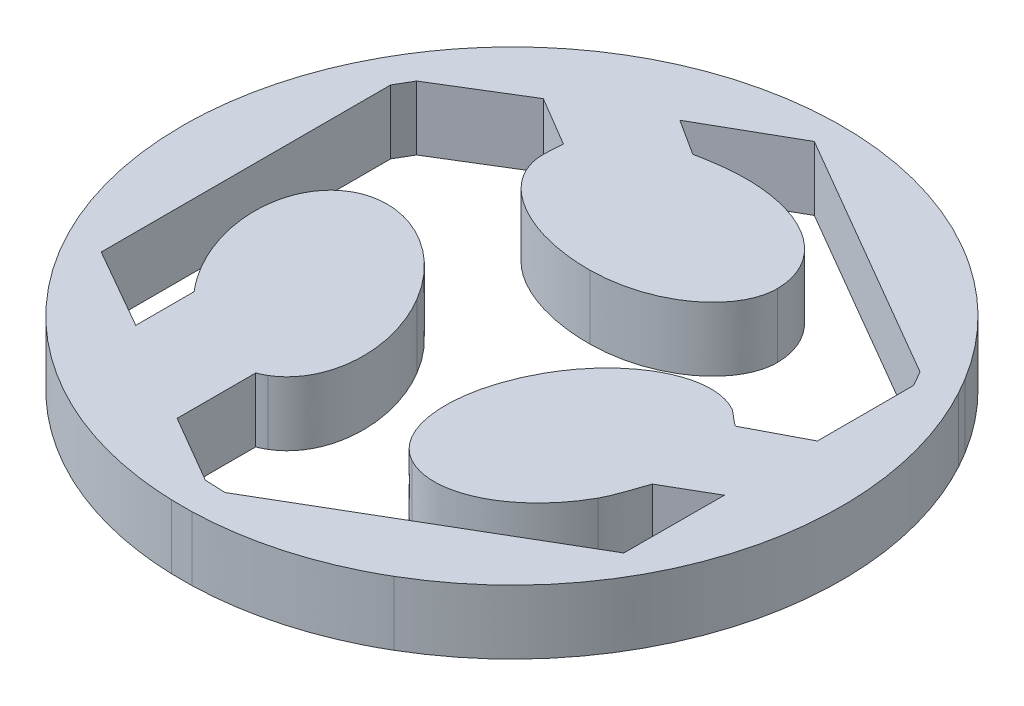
ISO-10303-21;
HEADER;
FILE_DESCRIPTION(('STEP AP214'),'2;1');
FILE_NAME('part.step','',(''),(''),'','','');
FILE_SCHEMA(('AUTOMOTIVE_DESIGN { 1 0 10303 214 1 1 1 1 }'));
ENDSEC;
DATA;
#1=APPLICATION_CONTEXT('core data for automotive mechanical design processes');
#2=APPLICATION_PROTOCOL_DEFINITION('international standard','automotive_design',2000,#1);
#3=PRODUCT_CONTEXT('',#1,'mechanical');
#4=PRODUCT('Part','Part','',(#3));
#5=PRODUCT_RELATED_PRODUCT_CATEGORY('part','',(#4));
#6=PRODUCT_DEFINITION_FORMATION('','',#4);
#7=PRODUCT_DEFINITION_CONTEXT('part definition',#1,'design');
#8=PRODUCT_DEFINITION('design','',#6,#7);
#9=PRODUCT_DEFINITION_SHAPE('','',#8);
#10=(LENGTH_UNIT() NAMED_UNIT(*) SI_UNIT(.MILLI.,.METRE.));
#11=(NAMED_UNIT(*) PLANE_ANGLE_UNIT() SI_UNIT($,.RADIAN.));
#12=(NAMED_UNIT(*) SI_UNIT($,.STERADIAN.) SOLID_ANGLE_UNIT());
#13=UNCERTAINTY_MEASURE_WITH_UNIT(LENGTH_MEASURE(1.E-05),#10,'distance_accuracy_value','');
#14=(GEOMETRIC_REPRESENTATION_CONTEXT(3) GLOBAL_UNCERTAINTY_ASSIGNED_CONTEXT((#13)) GLOBAL_UNIT_ASSIGNED_CONTEXT((#10,
#11,#12)) REPRESENTATION_CONTEXT('',''));
#15=CARTESIAN_POINT('',(0.,0.,0.));
#16=DIRECTION('',(0.,0.,1.));
#17=DIRECTION('',(1.,0.,0.));
#18=AXIS2_PLACEMENT_3D('',#15,#16,#17);
#19=CARTESIAN_POINT('',(82.209076,15.,-34.803937));
#20=CARTESIAN_POINT('',(94.753289,15.,-35.151917));
#21=CARTESIAN_POINT('',(107.389789,15.,-38.572732));
#22=CARTESIAN_POINT('',(118.982913,15.,-45.360741));
#23=B_SPLINE_CURVE_WITH_KNOTS('',3,(#19,#20,#21,#22),.UNSPECIFIED.,.F.,.F.,(4,4),(0.,1.),.UNSPECIFIED.);
#24=DIRECTION('',(0.,-1.,0.));
#25=VECTOR('',#24,1.);
#26=SURFACE_OF_LINEAR_EXTRUSION('',#23,#25);
#27=CARTESIAN_POINT('',(82.209076,0.,-34.803937));
#28=CARTESIAN_POINT('',(94.753289,0.,-35.151917));
#29=CARTESIAN_POINT('',(107.389789,0.,-38.572732));
#30=CARTESIAN_POINT('',(118.982913,0.,-45.360741));
#31=B_SPLINE_CURVE_WITH_KNOTS('',3,(#27,#28,#29,#30),.UNSPECIFIED.,.F.,.F.,(4,4),(0.,1.),.UNSPECIFIED.);
#32=CARTESIAN_POINT('',(82.209076,0.,-34.803937));
#33=VERTEX_POINT('',#32);
#34=CARTESIAN_POINT('',(118.982913,0.,-45.360741));
#35=VERTEX_POINT('',#34);
#36=EDGE_CURVE('E793',#33,#35,#31,.T.);
#37=ORIENTED_EDGE('',*,*,#36,.T.);
#38=DIRECTION('',(0.,-1.,0.));
#39=VECTOR('',#38,1.);
#40=CARTESIAN_POINT('',(118.982913,15.,-45.360741));
#41=LINE('',#40,#39);
#42=CARTESIAN_POINT('',(118.982913,15.,-45.360741));
#43=VERTEX_POINT('',#42);
#44=EDGE_CURVE('E11',#43,#35,#41,.T.);
#45=ORIENTED_EDGE('',*,*,#44,.F.);
#46=CARTESIAN_POINT('',(82.209076,15.,-34.803937));
#47=VERTEX_POINT('',#46);
#48=EDGE_CURVE('E393',#47,#43,#23,.T.);
#49=ORIENTED_EDGE('',*,*,#48,.F.);
#50=DIRECTION('',(0.,-1.,0.));
#51=VECTOR('',#50,1.);
#52=CARTESIAN_POINT('',(82.209076,15.,-34.803937));
#53=LINE('',#52,#51);
#54=EDGE_CURVE('E53',#47,#33,#53,.T.);
#55=ORIENTED_EDGE('',*,*,#54,.T.);
#56=EDGE_LOOP('',(#37,#45,#49,#55));
#57=FACE_BOUND('',#56,.T.);
#58=ADVANCED_FACE('F33',(#57),#26,.F.);
#59=CARTESIAN_POINT('',(118.982913,15.,-45.360741));
#60=CARTESIAN_POINT('',(155.002936,15.,-66.452901));
#61=CARTESIAN_POINT('',(167.592022,15.,-112.206486));
#62=CARTESIAN_POINT('',(147.852553,15.,-148.631779));
#63=B_SPLINE_CURVE_WITH_KNOTS('',3,(#59,#60,#61,#62),.UNSPECIFIED.,.F.,.F.,(4,4),(0.,1.),.UNSPECIFIED.);
#64=DIRECTION('',(0.,-1.,0.));
#65=VECTOR('',#64,1.);
#66=SURFACE_OF_LINEAR_EXTRUSION('',#63,#65);
#67=CARTESIAN_POINT('',(118.982913,0.,-45.360741));
#68=CARTESIAN_POINT('',(155.002936,0.,-66.452901));
#69=CARTESIAN_POINT('',(167.592022,0.,-112.206486));
#70=CARTESIAN_POINT('',(147.852553,0.,-148.631779));
#71=B_SPLINE_CURVE_WITH_KNOTS('',3,(#67,#68,#69,#70),.UNSPECIFIED.,.F.,.F.,(4,4),(0.,1.),.UNSPECIFIED.);
#72=CARTESIAN_POINT('',(147.852553,0.,-148.631779));
#73=VERTEX_POINT('',#72);
#74=EDGE_CURVE('E800',#35,#73,#71,.T.);
#75=ORIENTED_EDGE('',*,*,#74,.T.);
#76=DIRECTION('',(0.,-1.,0.));
#77=VECTOR('',#76,1.);
#78=CARTESIAN_POINT('',(147.852553,15.,-148.631779));
#79=LINE('',#78,#77);
#80=CARTESIAN_POINT('',(147.852553,15.,-148.631779));
#81=VERTEX_POINT('',#80);
#82=EDGE_CURVE('E44',#81,#73,#79,.T.);
#83=ORIENTED_EDGE('',*,*,#82,.F.);
#84=EDGE_CURVE('E388',#43,#81,#63,.T.);
#85=ORIENTED_EDGE('',*,*,#84,.F.);
#86=ORIENTED_EDGE('',*,*,#44,.T.);
#87=EDGE_LOOP('',(#75,#83,#85,#86));
#88=FACE_BOUND('',#87,.T.);
#89=ADVANCED_FACE('F402',(#88),#66,.F.);
#90=CARTESIAN_POINT('',(175.353475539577,15.,-100.782265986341));
#91=DIRECTION('',(0.867004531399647,0.,-0.498300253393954));
#92=DIRECTION('',(-0.498300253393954,0.,-0.867004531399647));
#93=AXIS2_PLACEMENT_3D('',#90,#91,#92);
#94=PLANE('',#93);
#95=DIRECTION('',(0.498300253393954,0.,0.867004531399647));
#96=VECTOR('',#95,1.);
#97=CARTESIAN_POINT('',(175.353475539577,0.,-100.782265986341));
#98=LINE('',#97,#96);
#99=CARTESIAN_POINT('',(145.85696,0.,-152.103959));
#100=VERTEX_POINT('',#99);
#101=EDGE_CURVE('E808',#100,#73,#98,.T.);
#102=ORIENTED_EDGE('',*,*,#101,.F.);
#103=DIRECTION('',(0.,-1.,0.));
#104=VECTOR('',#103,1.);
#105=CARTESIAN_POINT('',(145.85696,15.,-152.103959));
#106=LINE('',#105,#104);
#107=CARTESIAN_POINT('',(145.85696,15.,-152.103959));
#108=VERTEX_POINT('',#107);
#109=EDGE_CURVE('E851',#108,#100,#106,.T.);
#110=ORIENTED_EDGE('',*,*,#109,.F.);
#111=DIRECTION('',(0.498300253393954,0.,0.867004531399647));
#112=VECTOR('',#111,1.);
#113=CARTESIAN_POINT('',(175.353475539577,15.,-100.782265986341));
#114=LINE('',#113,#112);
#115=EDGE_CURVE('E382',#108,#81,#114,.T.);
#116=ORIENTED_EDGE('',*,*,#115,.T.);
#117=ORIENTED_EDGE('',*,*,#82,.T.);
#118=EDGE_LOOP('',(#102,#110,#116,#117));
#119=FACE_BOUND('',#118,.T.);
#120=ADVANCED_FACE('F405',(#119),#94,.T.);
#121=CARTESIAN_POINT('',(145.85696,15.,-152.103959));
#122=CARTESIAN_POINT('',(139.336216,15.,-162.825581));
#123=CARTESIAN_POINT('',(130.10134,15.,-172.104201));
#124=CARTESIAN_POINT('',(118.458544,15.,-178.807543));
#125=B_SPLINE_CURVE_WITH_KNOTS('',3,(#121,#122,#123,#124),.UNSPECIFIED.,.F.,.F.,(4,4),(0.,1.),.UNSPECIFIED.);
#126=DIRECTION('',(0.,-1.,0.));
#127=VECTOR('',#126,1.);
#128=SURFACE_OF_LINEAR_EXTRUSION('',#125,#127);
#129=CARTESIAN_POINT('',(145.85696,0.,-152.103959));
#130=CARTESIAN_POINT('',(139.336216,0.,-162.825581));
#131=CARTESIAN_POINT('',(130.10134,0.,-172.104201));
#132=CARTESIAN_POINT('',(118.458544,0.,-178.807543));
#133=B_SPLINE_CURVE_WITH_KNOTS('',3,(#129,#130,#131,#132),.UNSPECIFIED.,.F.,.F.,(4,4),(0.,1.),.UNSPECIFIED.);
#134=CARTESIAN_POINT('',(118.458544,0.,-178.807543));
#135=VERTEX_POINT('',#134);
#136=EDGE_CURVE('E814',#100,#135,#133,.T.);
#137=ORIENTED_EDGE('',*,*,#136,.T.);
#138=DIRECTION('',(0.,-1.,0.));
#139=VECTOR('',#138,1.);
#140=CARTESIAN_POINT('',(118.458544,15.,-178.807543));
#141=LINE('',#140,#139);
#142=CARTESIAN_POINT('',(118.458544,15.,-178.807543));
#143=VERTEX_POINT('',#142);
#144=EDGE_CURVE('E848',#143,#135,#141,.T.);
#145=ORIENTED_EDGE('',*,*,#144,.F.);
#146=EDGE_CURVE('E374',#108,#143,#125,.T.);
#147=ORIENTED_EDGE('',*,*,#146,.F.);
#148=ORIENTED_EDGE('',*,*,#109,.T.);
#149=EDGE_LOOP('',(#137,#145,#147,#148));
#150=FACE_BOUND('',#149,.T.);
#151=ADVANCED_FACE('F366',(#150),#128,.F.);
#152=CARTESIAN_POINT('',(118.458544,15.,-178.807543));
#153=CARTESIAN_POINT('',(82.283864,15.,-199.634697));
#154=CARTESIAN_POINT('',(36.30676,15.,-187.886632));
#155=CARTESIAN_POINT('',(14.458244,15.,-152.685619));
#156=B_SPLINE_CURVE_WITH_KNOTS('',3,(#152,#153,#154,#155),.UNSPECIFIED.,.F.,.F.,(4,4),(0.,1.),.UNSPECIFIED.);
#157=DIRECTION('',(0.,-1.,0.));
#158=VECTOR('',#157,1.);
#159=SURFACE_OF_LINEAR_EXTRUSION('',#156,#158);
#160=CARTESIAN_POINT('',(118.458544,0.,-178.807543));
#161=CARTESIAN_POINT('',(82.283864,0.,-199.634697));
#162=CARTESIAN_POINT('',(36.30676,0.,-187.886632));
#163=CARTESIAN_POINT('',(14.458244,0.,-152.685619));
#164=B_SPLINE_CURVE_WITH_KNOTS('',3,(#160,#161,#162,#163),.UNSPECIFIED.,.F.,.F.,(4,4),(0.,1.),.UNSPECIFIED.);
#165=CARTESIAN_POINT('',(14.458244,0.,-152.685619));
#166=VERTEX_POINT('',#165);
#167=EDGE_CURVE('E818',#135,#166,#164,.T.);
#168=ORIENTED_EDGE('',*,*,#167,.T.);
#169=DIRECTION('',(0.,-1.,0.));
#170=VECTOR('',#169,1.);
#171=CARTESIAN_POINT('',(14.458244,15.,-152.685619));
#172=LINE('',#171,#170);
#173=CARTESIAN_POINT('',(14.458244,15.,-152.685619));
#174=VERTEX_POINT('',#173);
#175=EDGE_CURVE('E845',#174,#166,#172,.T.);
#176=ORIENTED_EDGE('',*,*,#175,.F.);
#177=EDGE_CURVE('E370',#143,#174,#156,.T.);
#178=ORIENTED_EDGE('',*,*,#177,.F.);
#179=ORIENTED_EDGE('',*,*,#144,.T.);
#180=EDGE_LOOP('',(#168,#176,#178,#179));
#181=FACE_BOUND('',#180,.T.);
#182=ADVANCED_FACE('F361',(#181),#159,.F.);
#183=CARTESIAN_POINT('',(-55.7182166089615,15.,-32.5464931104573));
#184=DIRECTION('',(0.863480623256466,0.,0.504382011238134));
#185=DIRECTION('',(0.504382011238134,0.,-0.863480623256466));
#186=AXIS2_PLACEMENT_3D('',#183,#184,#185);
#187=PLANE('',#186);
#188=DIRECTION('',(-0.504382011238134,0.,0.863480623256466));
#189=VECTOR('',#188,1.);
#190=CARTESIAN_POINT('',(-55.7182166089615,0.,-32.5464931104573));
#191=LINE('',#190,#189);
#192=CARTESIAN_POINT('',(12.293882,0.,-148.980323));
#193=VERTEX_POINT('',#192);
#194=EDGE_CURVE('E825',#166,#193,#191,.T.);
#195=ORIENTED_EDGE('',*,*,#194,.T.);
#196=DIRECTION('',(0.,-1.,0.));
#197=VECTOR('',#196,1.);
#198=CARTESIAN_POINT('',(12.293882,15.,-148.980323));
#199=LINE('',#198,#197);
#200=CARTESIAN_POINT('',(12.293882,15.,-148.980323));
#201=VERTEX_POINT('',#200);
#202=EDGE_CURVE('E332',#201,#193,#199,.T.);
#203=ORIENTED_EDGE('',*,*,#202,.F.);
#204=DIRECTION('',(-0.504382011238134,0.,0.863480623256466));
#205=VECTOR('',#204,1.);
#206=CARTESIAN_POINT('',(-55.7182166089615,15.,-32.5464931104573));
#207=LINE('',#206,#205);
#208=EDGE_CURVE('E320',#174,#201,#207,.T.);
#209=ORIENTED_EDGE('',*,*,#208,.F.);
#210=ORIENTED_EDGE('',*,*,#175,.T.);
#211=EDGE_LOOP('',(#195,#203,#209,#210));
#212=FACE_BOUND('',#211,.T.);
#213=ADVANCED_FACE('F358',(#212),#187,.F.);
#214=CARTESIAN_POINT('',(12.293882,15.,-148.980323));
#215=CARTESIAN_POINT('',(6.25602,15.,-137.979583));
#216=CARTESIAN_POINT('',(2.822222,15.,-125.346752));
#217=CARTESIAN_POINT('',(2.822222,15.,-111.91241));
#218=B_SPLINE_CURVE_WITH_KNOTS('',3,(#214,#215,#216,#217),.UNSPECIFIED.,.F.,.F.,(4,4),(0.,1.),.UNSPECIFIED.);
#219=DIRECTION('',(0.,-1.,0.));
#220=VECTOR('',#219,1.);
#221=SURFACE_OF_LINEAR_EXTRUSION('',#218,#220);
#222=CARTESIAN_POINT('',(12.293882,0.,-148.980323));
#223=CARTESIAN_POINT('',(6.25602,0.,-137.979583));
#224=CARTESIAN_POINT('',(2.822222,0.,-125.346752));
#225=CARTESIAN_POINT('',(2.822222,0.,-111.91241));
#226=B_SPLINE_CURVE_WITH_KNOTS('',3,(#222,#223,#224,#225),.UNSPECIFIED.,.F.,.F.,(4,4),(0.,1.),.UNSPECIFIED.);
#227=CARTESIAN_POINT('',(2.822222,0.,-111.91241));
#228=VERTEX_POINT('',#227);
#229=EDGE_CURVE('E329',#193,#228,#226,.T.);
#230=ORIENTED_EDGE('',*,*,#229,.T.);
#231=DIRECTION('',(0.,-1.,0.));
#232=VECTOR('',#231,1.);
#233=CARTESIAN_POINT('',(2.822222,15.,-111.91241));
#234=LINE('',#233,#232);
#235=CARTESIAN_POINT('',(2.822222,15.,-111.91241));
#236=VERTEX_POINT('',#235);
#237=EDGE_CURVE('E326',#236,#228,#234,.T.);
#238=ORIENTED_EDGE('',*,*,#237,.F.);
#239=EDGE_CURVE('E312',#201,#236,#218,.T.);
#240=ORIENTED_EDGE('',*,*,#239,.F.);
#241=ORIENTED_EDGE('',*,*,#202,.T.);
#242=EDGE_LOOP('',(#230,#238,#240,#241));
#243=FACE_BOUND('',#242,.T.);
#244=ADVANCED_FACE('F327',(#243),#221,.F.);
#245=CARTESIAN_POINT('',(2.822222,15.,-111.91241));
#246=CARTESIAN_POINT('',(2.822222,15.,-70.170615));
#247=CARTESIAN_POINT('',(35.94354,15.,-36.18739));
#248=CARTESIAN_POINT('',(77.351467,15.,-34.81579));
#249=B_SPLINE_CURVE_WITH_KNOTS('',3,(#245,#246,#247,#248),.UNSPECIFIED.,.F.,.F.,(4,4),(0.,1.),.UNSPECIFIED.);
#250=DIRECTION('',(0.,-1.,0.));
#251=VECTOR('',#250,1.);
#252=SURFACE_OF_LINEAR_EXTRUSION('',#249,#251);
#253=CARTESIAN_POINT('',(2.822222,0.,-111.91241));
#254=CARTESIAN_POINT('',(2.822222,0.,-70.170615));
#255=CARTESIAN_POINT('',(35.94354,0.,-36.18739));
#256=CARTESIAN_POINT('',(77.351467,0.,-34.81579));
#257=B_SPLINE_CURVE_WITH_KNOTS('',3,(#253,#254,#255,#256),.UNSPECIFIED.,.F.,.F.,(4,4),(0.,1.),.UNSPECIFIED.);
#258=CARTESIAN_POINT('',(77.351467,0.,-34.81579));
#259=VERTEX_POINT('',#258);
#260=EDGE_CURVE('E539',#228,#259,#257,.T.);
#261=ORIENTED_EDGE('',*,*,#260,.T.);
#262=DIRECTION('',(0.,-1.,0.));
#263=VECTOR('',#262,1.);
#264=CARTESIAN_POINT('',(77.351467,15.,-34.81579));
#265=LINE('',#264,#263);
#266=CARTESIAN_POINT('',(77.351467,15.,-34.81579));
#267=VERTEX_POINT('',#266);
#268=EDGE_CURVE('E182',#267,#259,#265,.T.);
#269=ORIENTED_EDGE('',*,*,#268,.F.);
#270=EDGE_CURVE('E318',#236,#267,#249,.T.);
#271=ORIENTED_EDGE('',*,*,#270,.F.);
#272=ORIENTED_EDGE('',*,*,#237,.T.);
#273=EDGE_LOOP('',(#261,#269,#271,#272));
#274=FACE_BOUND('',#273,.T.);
#275=ADVANCED_FACE('F334',(#274),#252,.F.);
#276=CARTESIAN_POINT('',(97.521324,15.,-70.98031));
#277=CARTESIAN_POINT('',(106.418944,15.,-66.023923));
#278=CARTESIAN_POINT('',(119.667302,15.,-71.970628));
#279=CARTESIAN_POINT('',(126.986171,15.,-85.10525));
#280=B_SPLINE_CURVE_WITH_KNOTS('',3,(#276,#277,#278,#279),.UNSPECIFIED.,.F.,.F.,(4,4),(0.,1.),.UNSPECIFIED.);
#281=DIRECTION('',(0.,-1.,0.));
#282=VECTOR('',#281,1.);
#283=SURFACE_OF_LINEAR_EXTRUSION('',#280,#282);
#284=CARTESIAN_POINT('',(97.521324,0.,-70.98031));
#285=CARTESIAN_POINT('',(106.418944,0.,-66.023923));
#286=CARTESIAN_POINT('',(119.667302,0.,-71.970628));
#287=CARTESIAN_POINT('',(126.986171,0.,-85.10525));
#288=B_SPLINE_CURVE_WITH_KNOTS('',3,(#284,#285,#286,#287),.UNSPECIFIED.,.F.,.F.,(4,4),(0.,1.),.UNSPECIFIED.);
#289=CARTESIAN_POINT('',(97.521324,0.,-70.98031));
#290=VERTEX_POINT('',#289);
#291=CARTESIAN_POINT('',(126.986171,0.,-85.10525));
#292=VERTEX_POINT('',#291);
#293=EDGE_CURVE('E928',#290,#292,#288,.T.);
#294=ORIENTED_EDGE('',*,*,#293,.T.);
#295=DIRECTION('',(0.,-1.,0.));
#296=VECTOR('',#295,1.);
#297=CARTESIAN_POINT('',(126.986171,15.,-85.10525));
#298=LINE('',#297,#296);
#299=CARTESIAN_POINT('',(126.986171,15.,-85.10525));
#300=VERTEX_POINT('',#299);
#301=EDGE_CURVE('E38',#300,#292,#298,.T.);
#302=ORIENTED_EDGE('',*,*,#301,.F.);
#303=CARTESIAN_POINT('',(97.521324,15.,-70.98031));
#304=VERTEX_POINT('',#303);
#305=EDGE_CURVE('E526',#304,#300,#280,.T.);
#306=ORIENTED_EDGE('',*,*,#305,.F.);
#307=DIRECTION('',(0.,-1.,0.));
#308=VECTOR('',#307,1.);
#309=CARTESIAN_POINT('',(97.521324,15.,-70.98031));
#310=LINE('',#309,#308);
#311=EDGE_CURVE('E337',#304,#290,#310,.T.);
#312=ORIENTED_EDGE('',*,*,#311,.T.);
#313=EDGE_LOOP('',(#294,#302,#306,#312));
#314=FACE_BOUND('',#313,.T.);
#315=ADVANCED_FACE('F35',(#314),#283,.F.);
#316=CARTESIAN_POINT('',(126.986171,15.,-85.10525));
#317=CARTESIAN_POINT('',(128.166424,15.,-87.224175));
#318=CARTESIAN_POINT('',(129.742636,15.,-92.143308));
#319=CARTESIAN_POINT('',(130.479518,15.,-94.294123));
#320=B_SPLINE_CURVE_WITH_KNOTS('',3,(#316,#317,#318,#319),.UNSPECIFIED.,.F.,.F.,(4,4),(0.,1.),.UNSPECIFIED.);
#321=DIRECTION('',(0.,-1.,0.));
#322=VECTOR('',#321,1.);
#323=SURFACE_OF_LINEAR_EXTRUSION('',#320,#322);
#324=CARTESIAN_POINT('',(126.986171,0.,-85.10525));
#325=CARTESIAN_POINT('',(128.166424,0.,-87.224175));
#326=CARTESIAN_POINT('',(129.742636,0.,-92.143308));
#327=CARTESIAN_POINT('',(130.479518,0.,-94.294123));
#328=B_SPLINE_CURVE_WITH_KNOTS('',3,(#324,#325,#326,#327),.UNSPECIFIED.,.F.,.F.,(4,4),(0.,1.),.UNSPECIFIED.);
#329=CARTESIAN_POINT('',(130.479518,0.,-94.294123));
#330=VERTEX_POINT('',#329);
#331=EDGE_CURVE('E927',#292,#330,#328,.T.);
#332=ORIENTED_EDGE('',*,*,#331,.T.);
#333=DIRECTION('',(0.,-1.,0.));
#334=VECTOR('',#333,1.);
#335=CARTESIAN_POINT('',(130.479518,15.,-94.294123));
#336=LINE('',#335,#334);
#337=CARTESIAN_POINT('',(130.479518,15.,-94.294123));
#338=VERTEX_POINT('',#337);
#339=EDGE_CURVE('E923',#338,#330,#336,.T.);
#340=ORIENTED_EDGE('',*,*,#339,.F.);
#341=EDGE_CURVE('E195',#300,#338,#320,.T.);
#342=ORIENTED_EDGE('',*,*,#341,.F.);
#343=ORIENTED_EDGE('',*,*,#301,.T.);
#344=EDGE_LOOP('',(#332,#340,#342,#343));
#345=FACE_BOUND('',#344,.T.);
#346=ADVANCED_FACE('F555',(#345),#323,.F.);
#347=CARTESIAN_POINT('',(-8.17355305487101,15.,-14.1386205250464));
#348=DIRECTION('',(-0.500487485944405,0.,-0.865743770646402));
#349=DIRECTION('',(-0.865743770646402,0.,0.500487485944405));
#350=AXIS2_PLACEMENT_3D('',#347,#348,#349);
#351=PLANE('',#350);
#352=DIRECTION('',(0.865743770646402,0.,-0.500487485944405));
#353=VECTOR('',#352,1.);
#354=CARTESIAN_POINT('',(-8.17355305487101,0.,-14.1386205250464));
#355=LINE('',#354,#353);
#356=CARTESIAN_POINT('',(141.186464,0.,-100.483821));
#357=VERTEX_POINT('',#356);
#358=EDGE_CURVE('E929',#330,#357,#355,.T.);
#359=ORIENTED_EDGE('',*,*,#358,.T.);
#360=DIRECTION('',(0.,-1.,0.));
#361=VECTOR('',#360,1.);
#362=CARTESIAN_POINT('',(141.186464,15.,-100.483821));
#363=LINE('',#362,#361);
#364=CARTESIAN_POINT('',(141.186464,15.,-100.483821));
#365=VERTEX_POINT('',#364);
#366=EDGE_CURVE('E921',#365,#357,#363,.T.);
#367=ORIENTED_EDGE('',*,*,#366,.F.);
#368=DIRECTION('',(0.865743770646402,0.,-0.500487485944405));
#369=VECTOR('',#368,1.);
#370=CARTESIAN_POINT('',(-8.17355305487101,15.,-14.1386205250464));
#371=LINE('',#370,#369);
#372=EDGE_CURVE('E536',#338,#365,#371,.T.);
#373=ORIENTED_EDGE('',*,*,#372,.F.);
#374=ORIENTED_EDGE('',*,*,#339,.T.);
#375=EDGE_LOOP('',(#359,#367,#373,#374));
#376=FACE_BOUND('',#375,.T.);
#377=ADVANCED_FACE('F558',(#376),#351,.F.);
#378=CARTESIAN_POINT('',(140.913932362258,15.,0.380743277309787));
#379=DIRECTION('',(0.999996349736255,0.,0.00270194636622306));
#380=DIRECTION('',(0.00270194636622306,0.,-0.999996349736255));
#381=AXIS2_PLACEMENT_3D('',#378,#379,#380);
#382=PLANE('',#381);
#383=DIRECTION('',(-0.00270194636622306,0.,0.999996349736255));
#384=VECTOR('',#383,1.);
#385=CARTESIAN_POINT('',(140.913932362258,0.,0.380743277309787));
#386=LINE('',#385,#384);
#387=CARTESIAN_POINT('',(141.122964,0.,-76.98233));
#388=VERTEX_POINT('',#387);
#389=EDGE_CURVE('E943',#357,#388,#386,.T.);
#390=ORIENTED_EDGE('',*,*,#389,.T.);
#391=DIRECTION('',(0.,-1.,0.));
#392=VECTOR('',#391,1.);
#393=CARTESIAN_POINT('',(141.122964,15.,-76.98233));
#394=LINE('',#393,#392);
#395=CARTESIAN_POINT('',(141.122964,15.,-76.98233));
#396=VERTEX_POINT('',#395);
#397=EDGE_CURVE('E918',#396,#388,#394,.T.);
#398=ORIENTED_EDGE('',*,*,#397,.F.);
#399=DIRECTION('',(-0.00270194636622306,0.,0.999996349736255));
#400=VECTOR('',#399,1.);
#401=CARTESIAN_POINT('',(140.913932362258,15.,0.380743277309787));
#402=LINE('',#401,#400);
#403=EDGE_CURVE('E1023',#365,#396,#402,.T.);
#404=ORIENTED_EDGE('',*,*,#403,.F.);
#405=ORIENTED_EDGE('',*,*,#366,.T.);
#406=EDGE_LOOP('',(#390,#398,#404,#405));
#407=FACE_BOUND('',#406,.T.);
#408=ADVANCED_FACE('F561',(#407),#382,.F.);
#409=CARTESIAN_POINT('',(2.36646825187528,15.,4.05213793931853));
#410=DIRECTION('',(0.504303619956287,0.,0.863526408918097));
#411=DIRECTION('',(0.863526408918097,0.,-0.504303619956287));
#412=AXIS2_PLACEMENT_3D('',#409,#410,#411);
#413=PLANE('',#412);
#414=DIRECTION('',(-0.863526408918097,0.,0.504303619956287));
#415=VECTOR('',#414,1.);
#416=CARTESIAN_POINT('',(2.36646825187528,0.,4.05213793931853));
#417=LINE('',#416,#415);
#418=CARTESIAN_POINT('',(82.180571,0.,-42.559686));
#419=VERTEX_POINT('',#418);
#420=EDGE_CURVE('E945',#388,#419,#417,.T.);
#421=ORIENTED_EDGE('',*,*,#420,.T.);
#422=DIRECTION('',(0.,-1.,0.));
#423=VECTOR('',#422,1.);
#424=CARTESIAN_POINT('',(82.180571,15.,-42.559686));
#425=LINE('',#424,#423);
#426=CARTESIAN_POINT('',(82.180571,15.,-42.559686));
#427=VERTEX_POINT('',#426);
#428=EDGE_CURVE('E916',#427,#419,#425,.T.);
#429=ORIENTED_EDGE('',*,*,#428,.F.);
#430=DIRECTION('',(-0.863526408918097,0.,0.504303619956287));
#431=VECTOR('',#430,1.);
#432=CARTESIAN_POINT('',(2.36646825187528,15.,4.05213793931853));
#433=LINE('',#432,#431);
#434=EDGE_CURVE('E1024',#396,#427,#433,.T.);
#435=ORIENTED_EDGE('',*,*,#434,.F.);
#436=ORIENTED_EDGE('',*,*,#397,.T.);
#437=EDGE_LOOP('',(#421,#429,#435,#436));
#438=FACE_BOUND('',#437,.T.);
#439=ADVANCED_FACE('F565',(#438),#413,.F.);
#440=CARTESIAN_POINT('',(1.99079243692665,15.,-46.0280332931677));
#441=DIRECTION('',(0.0432113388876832,0.,-0.999065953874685));
#442=DIRECTION('',(-0.999065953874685,0.,-0.0432113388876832));
#443=AXIS2_PLACEMENT_3D('',#440,#441,#442);
#444=PLANE('',#443);
#445=DIRECTION('',(0.999065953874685,0.,0.0432113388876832));
#446=VECTOR('',#445,1.);
#447=CARTESIAN_POINT('',(1.99079243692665,0.,-46.0280332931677));
#448=LINE('',#447,#446);
#449=CARTESIAN_POINT('',(77.358522,0.,-42.768248));
#450=VERTEX_POINT('',#449);
#451=EDGE_CURVE('E948',#450,#419,#448,.T.);
#452=ORIENTED_EDGE('',*,*,#451,.F.);
#453=DIRECTION('',(0.,-1.,0.));
#454=VECTOR('',#453,1.);
#455=CARTESIAN_POINT('',(77.358522,15.,-42.768248));
#456=LINE('',#455,#454);
#457=CARTESIAN_POINT('',(77.358522,15.,-42.768248));
#458=VERTEX_POINT('',#457);
#459=EDGE_CURVE('E914',#458,#450,#456,.T.);
#460=ORIENTED_EDGE('',*,*,#459,.F.);
#461=DIRECTION('',(0.999065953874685,0.,0.0432113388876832));
#462=VECTOR('',#461,1.);
#463=CARTESIAN_POINT('',(1.99079243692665,15.,-46.0280332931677));
#464=LINE('',#463,#462);
#465=EDGE_CURVE('E1017',#458,#427,#464,.T.);
#466=ORIENTED_EDGE('',*,*,#465,.T.);
#467=ORIENTED_EDGE('',*,*,#428,.T.);
#468=EDGE_LOOP('',(#452,#460,#466,#467));
#469=FACE_BOUND('',#468,.T.);
#470=ADVANCED_FACE('F569',(#469),#444,.T.);
#471=CARTESIAN_POINT('',(38.2170737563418,15.,-65.5786075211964));
#472=DIRECTION('',(-0.503506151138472,0.,0.863991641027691));
#473=DIRECTION('',(0.863991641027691,0.,0.503506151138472));
#474=AXIS2_PLACEMENT_3D('',#471,#472,#473);
#475=PLANE('',#474);
#476=DIRECTION('',(-0.863991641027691,0.,-0.503506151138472));
#477=VECTOR('',#476,1.);
#478=CARTESIAN_POINT('',(38.2170737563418,0.,-65.5786075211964));
#479=LINE('',#478,#477);
#480=CARTESIAN_POINT('',(61.525009,0.,-51.995503));
#481=VERTEX_POINT('',#480);
#482=EDGE_CURVE('E951',#450,#481,#479,.T.);
#483=ORIENTED_EDGE('',*,*,#482,.T.);
#484=DIRECTION('',(0.,-1.,0.));
#485=VECTOR('',#484,1.);
#486=CARTESIAN_POINT('',(61.525009,15.,-51.995503));
#487=LINE('',#486,#485);
#488=CARTESIAN_POINT('',(61.525009,15.,-51.995503));
#489=VERTEX_POINT('',#488);
#490=EDGE_CURVE('E911',#489,#481,#487,.T.);
#491=ORIENTED_EDGE('',*,*,#490,.F.);
#492=DIRECTION('',(-0.863991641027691,0.,-0.503506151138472));
#493=VECTOR('',#492,1.);
#494=CARTESIAN_POINT('',(38.2170737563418,15.,-65.5786075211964));
#495=LINE('',#494,#493);
#496=EDGE_CURVE('E1027',#458,#489,#495,.T.);
#497=ORIENTED_EDGE('',*,*,#496,.F.);
#498=ORIENTED_EDGE('',*,*,#459,.T.);
#499=EDGE_LOOP('',(#483,#491,#497,#498));
#500=FACE_BOUND('',#499,.T.);
#501=ADVANCED_FACE('F573',(#500),#475,.F.);
#502=CARTESIAN_POINT('',(61.525009,15.,0.));
#503=DIRECTION('',(-1.,0.,0.));
#504=DIRECTION('',(0.,0.,1.));
#505=AXIS2_PLACEMENT_3D('',#502,#503,#504);
#506=PLANE('',#505);
#507=DIRECTION('',(0.,0.,-1.));
#508=VECTOR('',#507,1.);
#509=CARTESIAN_POINT('',(61.525009,0.,0.));
#510=LINE('',#509,#508);
#511=CARTESIAN_POINT('',(61.525009,0.,-70.397239));
#512=VERTEX_POINT('',#511);
#513=EDGE_CURVE('E953',#481,#512,#510,.T.);
#514=ORIENTED_EDGE('',*,*,#513,.T.);
#515=DIRECTION('',(0.,-1.,0.));
#516=VECTOR('',#515,1.);
#517=CARTESIAN_POINT('',(61.525009,15.,-70.397239));
#518=LINE('',#517,#516);
#519=CARTESIAN_POINT('',(61.525009,15.,-70.397239));
#520=VERTEX_POINT('',#519);
#521=EDGE_CURVE('E908',#520,#512,#518,.T.);
#522=ORIENTED_EDGE('',*,*,#521,.F.);
#523=DIRECTION('',(0.,0.,-1.));
#524=VECTOR('',#523,1.);
#525=CARTESIAN_POINT('',(61.525009,15.,0.));
#526=LINE('',#525,#524);
#527=EDGE_CURVE('E596',#489,#520,#526,.T.);
#528=ORIENTED_EDGE('',*,*,#527,.F.);
#529=ORIENTED_EDGE('',*,*,#490,.T.);
#530=EDGE_LOOP('',(#514,#522,#528,#529));
#531=FACE_BOUND('',#530,.T.);
#532=ADVANCED_FACE('F577',(#531),#506,.F.);
#533=CARTESIAN_POINT('',(61.525009,15.,-70.397239));
#534=CARTESIAN_POINT('',(62.185409,15.,-70.649828));
#535=CARTESIAN_POINT('',(62.829722,15.,-70.951241));
#536=CARTESIAN_POINT('',(63.448353,15.,-71.316437));
#537=B_SPLINE_CURVE_WITH_KNOTS('',3,(#533,#534,#535,#536),.UNSPECIFIED.,.F.,.F.,(4,4),(0.,1.),.UNSPECIFIED.);
#538=DIRECTION('',(0.,-1.,0.));
#539=VECTOR('',#538,1.);
#540=SURFACE_OF_LINEAR_EXTRUSION('',#537,#539);
#541=CARTESIAN_POINT('',(61.525009,0.,-70.397239));
#542=CARTESIAN_POINT('',(62.185409,0.,-70.649828));
#543=CARTESIAN_POINT('',(62.829722,0.,-70.951241));
#544=CARTESIAN_POINT('',(63.448353,0.,-71.316437));
#545=B_SPLINE_CURVE_WITH_KNOTS('',3,(#541,#542,#543,#544),.UNSPECIFIED.,.F.,.F.,(4,4),(0.,1.),.UNSPECIFIED.);
#546=CARTESIAN_POINT('',(63.448353,0.,-71.316437));
#547=VERTEX_POINT('',#546);
#548=EDGE_CURVE('E955',#512,#547,#545,.T.);
#549=ORIENTED_EDGE('',*,*,#548,.T.);
#550=DIRECTION('',(0.,-1.,0.));
#551=VECTOR('',#550,1.);
#552=CARTESIAN_POINT('',(63.448353,15.,-71.316437));
#553=LINE('',#552,#551);
#554=CARTESIAN_POINT('',(63.448353,15.,-71.316437));
#555=VERTEX_POINT('',#554);
#556=EDGE_CURVE('E905',#555,#547,#553,.T.);
#557=ORIENTED_EDGE('',*,*,#556,.F.);
#558=EDGE_CURVE('E590',#520,#555,#537,.T.);
#559=ORIENTED_EDGE('',*,*,#558,.F.);
#560=ORIENTED_EDGE('',*,*,#521,.T.);
#561=EDGE_LOOP('',(#549,#557,#559,#560));
#562=FACE_BOUND('',#561,.T.);
#563=ADVANCED_FACE('F581',(#562),#540,.F.);
#564=CARTESIAN_POINT('',(63.448353,15.,-71.316437));
#565=CARTESIAN_POINT('',(72.221796,15.,-76.488723));
#566=CARTESIAN_POINT('',(73.144098,15.,-91.18347));
#567=CARTESIAN_POINT('',(65.5066,15.,-104.135495));
#568=B_SPLINE_CURVE_WITH_KNOTS('',3,(#564,#565,#566,#567),.UNSPECIFIED.,.F.,.F.,(4,4),(0.,1.),.UNSPECIFIED.);
#569=DIRECTION('',(0.,-1.,0.));
#570=VECTOR('',#569,1.);
#571=SURFACE_OF_LINEAR_EXTRUSION('',#568,#570);
#572=CARTESIAN_POINT('',(63.448353,0.,-71.316437));
#573=CARTESIAN_POINT('',(72.221796,0.,-76.488723));
#574=CARTESIAN_POINT('',(73.144098,0.,-91.18347));
#575=CARTESIAN_POINT('',(65.5066,0.,-104.135495));
#576=B_SPLINE_CURVE_WITH_KNOTS('',3,(#572,#573,#574,#575),.UNSPECIFIED.,.F.,.F.,(4,4),(0.,1.),.UNSPECIFIED.);
#577=CARTESIAN_POINT('',(65.5066,0.,-104.135495));
#578=VERTEX_POINT('',#577);
#579=EDGE_CURVE('E959',#547,#578,#576,.T.);
#580=ORIENTED_EDGE('',*,*,#579,.T.);
#581=DIRECTION('',(0.,-1.,0.));
#582=VECTOR('',#581,1.);
#583=CARTESIAN_POINT('',(65.5066,15.,-104.135495));
#584=LINE('',#583,#582);
#585=CARTESIAN_POINT('',(65.5066,15.,-104.135495));
#586=VERTEX_POINT('',#585);
#587=EDGE_CURVE('E902',#586,#578,#584,.T.);
#588=ORIENTED_EDGE('',*,*,#587,.F.);
#589=EDGE_CURVE('E595',#555,#586,#568,.T.);
#590=ORIENTED_EDGE('',*,*,#589,.F.);
#591=ORIENTED_EDGE('',*,*,#556,.T.);
#592=EDGE_LOOP('',(#580,#588,#590,#591));
#593=FACE_BOUND('',#592,.T.);
#594=ADVANCED_FACE('F586',(#593),#571,.F.);
#595=CARTESIAN_POINT('',(65.5066,15.,-104.135495));
#596=CARTESIAN_POINT('',(57.869949,15.,-117.088083));
#597=CARTESIAN_POINT('',(44.56684,15.,-123.394339));
#598=CARTESIAN_POINT('',(35.79368,15.,-118.22177));
#599=B_SPLINE_CURVE_WITH_KNOTS('',3,(#595,#596,#597,#598),.UNSPECIFIED.,.F.,.F.,(4,4),(0.,1.),.UNSPECIFIED.);
#600=DIRECTION('',(0.,-1.,0.));
#601=VECTOR('',#600,1.);
#602=SURFACE_OF_LINEAR_EXTRUSION('',#599,#601);
#603=CARTESIAN_POINT('',(65.5066,0.,-104.135495));
#604=CARTESIAN_POINT('',(57.869949,0.,-117.088083));
#605=CARTESIAN_POINT('',(44.56684,0.,-123.394339));
#606=CARTESIAN_POINT('',(35.79368,0.,-118.22177));
#607=B_SPLINE_CURVE_WITH_KNOTS('',3,(#603,#604,#605,#606),.UNSPECIFIED.,.F.,.F.,(4,4),(0.,1.),.UNSPECIFIED.);
#608=CARTESIAN_POINT('',(35.79368,0.,-118.22177));
#609=VERTEX_POINT('',#608);
#610=EDGE_CURVE('E966',#578,#609,#607,.T.);
#611=ORIENTED_EDGE('',*,*,#610,.T.);
#612=DIRECTION('',(0.,-1.,0.));
#613=VECTOR('',#612,1.);
#614=CARTESIAN_POINT('',(35.79368,15.,-118.22177));
#615=LINE('',#614,#613);
#616=CARTESIAN_POINT('',(35.79368,15.,-118.22177));
#617=VERTEX_POINT('',#616);
#618=EDGE_CURVE('E899',#617,#609,#615,.T.);
#619=ORIENTED_EDGE('',*,*,#618,.F.);
#620=EDGE_CURVE('E605',#586,#617,#599,.T.);
#621=ORIENTED_EDGE('',*,*,#620,.F.);
#622=ORIENTED_EDGE('',*,*,#587,.T.);
#623=EDGE_LOOP('',(#611,#619,#621,#622));
#624=FACE_BOUND('',#623,.T.);
#625=ADVANCED_FACE('F621',(#624),#602,.F.);
#626=CARTESIAN_POINT('',(35.79368,15.,-118.22177));
#627=CARTESIAN_POINT('',(27.020238,15.,-113.048919));
#628=CARTESIAN_POINT('',(26.098218,15.,-98.355019));
#629=CARTESIAN_POINT('',(33.734304,15.,-85.402712));
#630=B_SPLINE_CURVE_WITH_KNOTS('',3,(#626,#627,#628,#629),.UNSPECIFIED.,.F.,.F.,(4,4),(0.,1.),.UNSPECIFIED.);
#631=DIRECTION('',(0.,-1.,0.));
#632=VECTOR('',#631,1.);
#633=SURFACE_OF_LINEAR_EXTRUSION('',#630,#632);
#634=CARTESIAN_POINT('',(35.79368,0.,-118.22177));
#635=CARTESIAN_POINT('',(27.020238,0.,-113.048919));
#636=CARTESIAN_POINT('',(26.098218,0.,-98.355019));
#637=CARTESIAN_POINT('',(33.734304,0.,-85.402712));
#638=B_SPLINE_CURVE_WITH_KNOTS('',3,(#634,#635,#636,#637),.UNSPECIFIED.,.F.,.F.,(4,4),(0.,1.),.UNSPECIFIED.);
#639=CARTESIAN_POINT('',(33.734304,0.,-85.402712));
#640=VERTEX_POINT('',#639);
#641=EDGE_CURVE('E973',#609,#640,#638,.T.);
#642=ORIENTED_EDGE('',*,*,#641,.T.);
#643=DIRECTION('',(0.,-1.,0.));
#644=VECTOR('',#643,1.);
#645=CARTESIAN_POINT('',(33.734304,15.,-85.402712));
#646=LINE('',#645,#644);
#647=CARTESIAN_POINT('',(33.734304,15.,-85.402712));
#648=VERTEX_POINT('',#647);
#649=EDGE_CURVE('E896',#648,#640,#646,.T.);
#650=ORIENTED_EDGE('',*,*,#649,.F.);
#651=EDGE_CURVE('E613',#617,#648,#630,.T.);
#652=ORIENTED_EDGE('',*,*,#651,.F.);
#653=ORIENTED_EDGE('',*,*,#618,.T.);
#654=EDGE_LOOP('',(#642,#650,#652,#653));
#655=FACE_BOUND('',#654,.T.);
#656=ADVANCED_FACE('F624',(#655),#633,.F.);
#657=CARTESIAN_POINT('',(33.734304,15.,-85.402712));
#658=CARTESIAN_POINT('',(34.966487,15.,-83.313421));
#659=CARTESIAN_POINT('',(36.347118,15.,-81.400237));
#660=CARTESIAN_POINT('',(37.831324,15.,-79.67727));
#661=B_SPLINE_CURVE_WITH_KNOTS('',3,(#657,#658,#659,#660),.UNSPECIFIED.,.F.,.F.,(4,4),(0.,1.),.UNSPECIFIED.);
#662=DIRECTION('',(0.,-1.,0.));
#663=VECTOR('',#662,1.);
#664=SURFACE_OF_LINEAR_EXTRUSION('',#661,#663);
#665=CARTESIAN_POINT('',(33.734304,0.,-85.402712));
#666=CARTESIAN_POINT('',(34.966487,0.,-83.313421));
#667=CARTESIAN_POINT('',(36.347118,0.,-81.400237));
#668=CARTESIAN_POINT('',(37.831324,0.,-79.67727));
#669=B_SPLINE_CURVE_WITH_KNOTS('',3,(#665,#666,#667,#668),.UNSPECIFIED.,.F.,.F.,(4,4),(0.,1.),.UNSPECIFIED.);
#670=CARTESIAN_POINT('',(37.831324,0.,-79.67727));
#671=VERTEX_POINT('',#670);
#672=EDGE_CURVE('E980',#640,#671,#669,.T.);
#673=ORIENTED_EDGE('',*,*,#672,.T.);
#674=DIRECTION('',(0.,-1.,0.));
#675=VECTOR('',#674,1.);
#676=CARTESIAN_POINT('',(37.831324,15.,-79.67727));
#677=LINE('',#676,#675);
#678=CARTESIAN_POINT('',(37.831324,15.,-79.67727));
#679=VERTEX_POINT('',#678);
#680=EDGE_CURVE('E893',#679,#671,#677,.T.);
#681=ORIENTED_EDGE('',*,*,#680,.F.);
#682=EDGE_CURVE('E635',#648,#679,#661,.T.);
#683=ORIENTED_EDGE('',*,*,#682,.F.);
#684=ORIENTED_EDGE('',*,*,#649,.T.);
#685=EDGE_LOOP('',(#673,#681,#683,#684));
#686=FACE_BOUND('',#685,.T.);
#687=ADVANCED_FACE('F628',(#686),#664,.F.);
#688=CARTESIAN_POINT('',(37.831324,15.,0.));
#689=DIRECTION('',(1.,0.,0.));
#690=DIRECTION('',(0.,0.,-1.));
#691=AXIS2_PLACEMENT_3D('',#688,#689,#690);
#692=PLANE('',#691);
#693=DIRECTION('',(0.,0.,1.));
#694=VECTOR('',#693,1.);
#695=CARTESIAN_POINT('',(37.831324,0.,0.));
#696=LINE('',#695,#694);
#697=CARTESIAN_POINT('',(37.831324,0.,-66.006708));
#698=VERTEX_POINT('',#697);
#699=EDGE_CURVE('E711',#671,#698,#696,.T.);
#700=ORIENTED_EDGE('',*,*,#699,.T.);
#701=DIRECTION('',(0.,-1.,0.));
#702=VECTOR('',#701,1.);
#703=CARTESIAN_POINT('',(37.831324,15.,-66.006708));
#704=LINE('',#703,#702);
#705=CARTESIAN_POINT('',(37.831324,15.,-66.006708));
#706=VERTEX_POINT('',#705);
#707=EDGE_CURVE('E706',#706,#698,#704,.T.);
#708=ORIENTED_EDGE('',*,*,#707,.F.);
#709=DIRECTION('',(0.,0.,1.));
#710=VECTOR('',#709,1.);
#711=CARTESIAN_POINT('',(37.831324,15.,0.));
#712=LINE('',#711,#710);
#713=EDGE_CURVE('E640',#679,#706,#712,.T.);
#714=ORIENTED_EDGE('',*,*,#713,.F.);
#715=ORIENTED_EDGE('',*,*,#680,.T.);
#716=EDGE_LOOP('',(#700,#708,#714,#715));
#717=FACE_BOUND('',#716,.T.);
#718=ADVANCED_FACE('F632',(#717),#692,.F.);
#719=CARTESIAN_POINT('',(37.7884540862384,15.,-66.0312416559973));
#720=DIRECTION('',(-0.496696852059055,0.,0.867924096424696));
#721=DIRECTION('',(0.867924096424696,0.,0.496696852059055));
#722=AXIS2_PLACEMENT_3D('',#719,#720,#721);
#723=PLANE('',#722);
#724=DIRECTION('',(-0.867924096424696,0.,-0.496696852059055));
#725=VECTOR('',#724,1.);
#726=CARTESIAN_POINT('',(37.7884540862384,0.,-66.0312416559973));
#727=LINE('',#726,#725);
#728=CARTESIAN_POINT('',(18.921871,0.,-76.828237));
#729=VERTEX_POINT('',#728);
#730=EDGE_CURVE('E700',#698,#729,#727,.T.);
#731=ORIENTED_EDGE('',*,*,#730,.T.);
#732=DIRECTION('',(0.,-1.,0.));
#733=VECTOR('',#732,1.);
#734=CARTESIAN_POINT('',(18.921871,15.,-76.828237));
#735=LINE('',#734,#733);
#736=CARTESIAN_POINT('',(18.921871,15.,-76.828237));
#737=VERTEX_POINT('',#736);
#738=EDGE_CURVE('E703',#737,#729,#735,.T.);
#739=ORIENTED_EDGE('',*,*,#738,.F.);
#740=DIRECTION('',(-0.867924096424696,0.,-0.496696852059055));
#741=VECTOR('',#740,1.);
#742=CARTESIAN_POINT('',(37.7884540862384,15.,-66.0312416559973));
#743=LINE('',#742,#741);
#744=EDGE_CURVE('E645',#706,#737,#743,.T.);
#745=ORIENTED_EDGE('',*,*,#744,.F.);
#746=ORIENTED_EDGE('',*,*,#707,.T.);
#747=EDGE_LOOP('',(#731,#739,#745,#746));
#748=FACE_BOUND('',#747,.T.);
#749=ADVANCED_FACE('F689',(#748),#723,.F.);
#750=CARTESIAN_POINT('',(18.921871,15.,0.));
#751=DIRECTION('',(-1.,0.,0.));
#752=DIRECTION('',(0.,0.,1.));
#753=AXIS2_PLACEMENT_3D('',#750,#751,#752);
#754=PLANE('',#753);
#755=DIRECTION('',(0.,0.,-1.));
#756=VECTOR('',#755,1.);
#757=CARTESIAN_POINT('',(18.921871,0.,0.));
#758=LINE('',#757,#756);
#759=CARTESIAN_POINT('',(18.921871,0.,-144.605032));
#760=VERTEX_POINT('',#759);
#761=EDGE_CURVE('E710',#729,#760,#758,.T.);
#762=ORIENTED_EDGE('',*,*,#761,.T.);
#763=DIRECTION('',(0.,-1.,0.));
#764=VECTOR('',#763,1.);
#765=CARTESIAN_POINT('',(18.921871,15.,-144.605032));
#766=LINE('',#765,#764);
#767=CARTESIAN_POINT('',(18.921871,15.,-144.605032));
#768=VERTEX_POINT('',#767);
#769=EDGE_CURVE('E716',#768,#760,#766,.T.);
#770=ORIENTED_EDGE('',*,*,#769,.F.);
#771=DIRECTION('',(0.,0.,-1.));
#772=VECTOR('',#771,1.);
#773=CARTESIAN_POINT('',(18.921871,15.,0.));
#774=LINE('',#773,#772);
#775=EDGE_CURVE('E647',#737,#768,#774,.T.);
#776=ORIENTED_EDGE('',*,*,#775,.F.);
#777=ORIENTED_EDGE('',*,*,#738,.T.);
#778=EDGE_LOOP('',(#762,#770,#776,#777));
#779=FACE_BOUND('',#778,.T.);
#780=ADVANCED_FACE('F686',(#779),#754,.F.);
#781=CARTESIAN_POINT('',(-49.1889427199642,15.,-28.9740622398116));
#782=DIRECTION('',(0.861632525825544,0.,0.507532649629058));
#783=DIRECTION('',(0.507532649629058,0.,-0.861632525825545));
#784=AXIS2_PLACEMENT_3D('',#781,#782,#783);
#785=PLANE('',#784);
#786=DIRECTION('',(-0.507532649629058,0.,0.861632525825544));
#787=VECTOR('',#786,1.);
#788=CARTESIAN_POINT('',(-49.1889427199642,0.,-28.9740622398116));
#789=LINE('',#788,#787);
#790=CARTESIAN_POINT('',(21.18106,0.,-148.440432));
#791=VERTEX_POINT('',#790);
#792=EDGE_CURVE('E722',#791,#760,#789,.T.);
#793=ORIENTED_EDGE('',*,*,#792,.F.);
#794=DIRECTION('',(0.,-1.,0.));
#795=VECTOR('',#794,1.);
#796=CARTESIAN_POINT('',(21.18106,15.,-148.440432));
#797=LINE('',#796,#795);
#798=CARTESIAN_POINT('',(21.18106,15.,-148.440432));
#799=VERTEX_POINT('',#798);
#800=EDGE_CURVE('E889',#799,#791,#797,.T.);
#801=ORIENTED_EDGE('',*,*,#800,.F.);
#802=DIRECTION('',(-0.507532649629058,0.,0.861632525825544));
#803=VECTOR('',#802,1.);
#804=CARTESIAN_POINT('',(-49.1889427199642,15.,-28.9740622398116));
#805=LINE('',#804,#803);
#806=EDGE_CURVE('E649',#799,#768,#805,.T.);
#807=ORIENTED_EDGE('',*,*,#806,.T.);
#808=ORIENTED_EDGE('',*,*,#769,.T.);
#809=EDGE_LOOP('',(#793,#801,#807,#808));
#810=FACE_BOUND('',#809,.T.);
#811=ADVANCED_FACE('F682',(#810),#785,.T.);
#812=CARTESIAN_POINT('',(-60.3272561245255,15.,-98.5403187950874));
#813=DIRECTION('',(-0.522131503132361,0.,-0.852864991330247));
#814=DIRECTION('',(-0.852864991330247,0.,0.522131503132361));
#815=AXIS2_PLACEMENT_3D('',#812,#813,#814);
#816=PLANE('',#815);
#817=DIRECTION('',(0.852864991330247,0.,-0.522131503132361));
#818=VECTOR('',#817,1.);
#819=CARTESIAN_POINT('',(-60.3272561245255,0.,-98.5403187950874));
#820=LINE('',#819,#818);
#821=CARTESIAN_POINT('',(39.56304,0.,-159.694043));
#822=VERTEX_POINT('',#821);
#823=EDGE_CURVE('E724',#791,#822,#820,.T.);
#824=ORIENTED_EDGE('',*,*,#823,.T.);
#825=DIRECTION('',(0.,-1.,0.));
#826=VECTOR('',#825,1.);
#827=CARTESIAN_POINT('',(39.56304,15.,-159.694043));
#828=LINE('',#827,#826);
#829=CARTESIAN_POINT('',(39.56304,15.,-159.694043));
#830=VERTEX_POINT('',#829);
#831=EDGE_CURVE('E886',#830,#822,#828,.T.);
#832=ORIENTED_EDGE('',*,*,#831,.F.);
#833=DIRECTION('',(0.852864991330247,0.,-0.522131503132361));
#834=VECTOR('',#833,1.);
#835=CARTESIAN_POINT('',(-60.3272561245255,15.,-98.5403187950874));
#836=LINE('',#835,#834);
#837=EDGE_CURVE('E652',#799,#830,#836,.T.);
#838=ORIENTED_EDGE('',*,*,#837,.F.);
#839=ORIENTED_EDGE('',*,*,#800,.T.);
#840=EDGE_LOOP('',(#824,#832,#838,#839));
#841=FACE_BOUND('',#840,.T.);
#842=ADVANCED_FACE('F678',(#841),#816,.F.);
#843=CARTESIAN_POINT('',(80.3251000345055,15.,-135.536610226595));
#844=DIRECTION('',(0.509835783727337,0.,-0.860271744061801));
#845=DIRECTION('',(-0.860271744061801,0.,-0.509835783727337));
#846=AXIS2_PLACEMENT_3D('',#843,#844,#845);
#847=PLANE('',#846);
#848=DIRECTION('',(0.860271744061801,0.,0.509835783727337));
#849=VECTOR('',#848,1.);
#850=CARTESIAN_POINT('',(80.3251000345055,0.,-135.536610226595));
#851=LINE('',#850,#849);
#852=CARTESIAN_POINT('',(51.120604,0.,-152.84451));
#853=VERTEX_POINT('',#852);
#854=EDGE_CURVE('E729',#822,#853,#851,.T.);
#855=ORIENTED_EDGE('',*,*,#854,.T.);
#856=DIRECTION('',(0.,-1.,0.));
#857=VECTOR('',#856,1.);
#858=CARTESIAN_POINT('',(51.120604,15.,-152.84451));
#859=LINE('',#858,#857);
#860=CARTESIAN_POINT('',(51.120604,15.,-152.84451));
#861=VERTEX_POINT('',#860);
#862=EDGE_CURVE('E883',#861,#853,#859,.T.);
#863=ORIENTED_EDGE('',*,*,#862,.F.);
#864=DIRECTION('',(0.860271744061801,0.,0.509835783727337));
#865=VECTOR('',#864,1.);
#866=CARTESIAN_POINT('',(80.3251000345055,15.,-135.536610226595));
#867=LINE('',#866,#865);
#868=EDGE_CURVE('E654',#830,#861,#867,.T.);
#869=ORIENTED_EDGE('',*,*,#868,.F.);
#870=ORIENTED_EDGE('',*,*,#831,.T.);
#871=EDGE_LOOP('',(#855,#863,#869,#870));
#872=FACE_BOUND('',#871,.T.);
#873=ADVANCED_FACE('F674',(#872),#847,.F.);
#874=CARTESIAN_POINT('',(51.120604,15.,-152.84451));
#875=CARTESIAN_POINT('',(50.892851,15.,-150.945437));
#876=CARTESIAN_POINT('',(50.885513,15.,-148.854735));
#877=CARTESIAN_POINT('',(50.892851,15.,-148.135915));
#878=B_SPLINE_CURVE_WITH_KNOTS('',3,(#874,#875,#876,#877),.UNSPECIFIED.,.F.,.F.,(4,4),(0.,1.),.UNSPECIFIED.);
#879=DIRECTION('',(0.,-1.,0.));
#880=VECTOR('',#879,1.);
#881=SURFACE_OF_LINEAR_EXTRUSION('',#878,#880);
#882=CARTESIAN_POINT('',(51.120604,0.,-152.84451));
#883=CARTESIAN_POINT('',(50.892851,0.,-150.945437));
#884=CARTESIAN_POINT('',(50.885513,0.,-148.854735));
#885=CARTESIAN_POINT('',(50.892851,0.,-148.135915));
#886=B_SPLINE_CURVE_WITH_KNOTS('',3,(#882,#883,#884,#885),.UNSPECIFIED.,.F.,.F.,(4,4),(0.,1.),.UNSPECIFIED.);
#887=CARTESIAN_POINT('',(50.892851,0.,-148.135915));
#888=VERTEX_POINT('',#887);
#889=EDGE_CURVE('E731',#853,#888,#886,.T.);
#890=ORIENTED_EDGE('',*,*,#889,.T.);
#891=DIRECTION('',(0.,-1.,0.));
#892=VECTOR('',#891,1.);
#893=CARTESIAN_POINT('',(50.892851,15.,-148.135915));
#894=LINE('',#893,#892);
#895=CARTESIAN_POINT('',(50.892851,15.,-148.135915));
#896=VERTEX_POINT('',#895);
#897=EDGE_CURVE('E880',#896,#888,#894,.T.);
#898=ORIENTED_EDGE('',*,*,#897,.F.);
#899=EDGE_CURVE('E656',#861,#896,#878,.T.);
#900=ORIENTED_EDGE('',*,*,#899,.F.);
#901=ORIENTED_EDGE('',*,*,#862,.T.);
#902=EDGE_LOOP('',(#890,#898,#900,#901));
#903=FACE_BOUND('',#902,.T.);
#904=ADVANCED_FACE('F669',(#903),#881,.F.);
#905=CARTESIAN_POINT('',(50.892851,15.,-148.135915));
#906=CARTESIAN_POINT('',(50.998684,15.,-137.951926));
#907=CARTESIAN_POINT('',(64.790884,15.,-130.210006));
#908=CARTESIAN_POINT('',(79.826273,15.,-130.365792));
#909=B_SPLINE_CURVE_WITH_KNOTS('',3,(#905,#906,#907,#908),.UNSPECIFIED.,.F.,.F.,(4,4),(0.,1.),.UNSPECIFIED.);
#910=DIRECTION('',(0.,-1.,0.));
#911=VECTOR('',#910,1.);
#912=SURFACE_OF_LINEAR_EXTRUSION('',#909,#911);
#913=CARTESIAN_POINT('',(50.892851,0.,-148.135915));
#914=CARTESIAN_POINT('',(50.998684,0.,-137.951926));
#915=CARTESIAN_POINT('',(64.790884,0.,-130.210006));
#916=CARTESIAN_POINT('',(79.826273,0.,-130.365792));
#917=B_SPLINE_CURVE_WITH_KNOTS('',3,(#913,#914,#915,#916),.UNSPECIFIED.,.F.,.F.,(4,4),(0.,1.),.UNSPECIFIED.);
#918=CARTESIAN_POINT('',(79.826273,0.,-130.365792));
#919=VERTEX_POINT('',#918);
#920=EDGE_CURVE('E735',#888,#919,#917,.T.);
#921=ORIENTED_EDGE('',*,*,#920,.T.);
#922=DIRECTION('',(0.,-1.,0.));
#923=VECTOR('',#922,1.);
#924=CARTESIAN_POINT('',(79.826273,15.,-130.365792));
#925=LINE('',#924,#923);
#926=CARTESIAN_POINT('',(79.826273,15.,-130.365792));
#927=VERTEX_POINT('',#926);
#928=EDGE_CURVE('E877',#927,#919,#925,.T.);
#929=ORIENTED_EDGE('',*,*,#928,.F.);
#930=EDGE_CURVE('E661',#896,#927,#909,.T.);
#931=ORIENTED_EDGE('',*,*,#930,.F.);
#932=ORIENTED_EDGE('',*,*,#897,.T.);
#933=EDGE_LOOP('',(#921,#929,#931,#932));
#934=FACE_BOUND('',#933,.T.);
#935=ADVANCED_FACE('F673',(#934),#912,.F.);
#936=CARTESIAN_POINT('',(79.826273,15.,-130.365792));
#937=CARTESIAN_POINT('',(94.861662,15.,-130.521579));
#938=CARTESIAN_POINT('',(105.570302,15.,-139.630301));
#939=CARTESIAN_POINT('',(105.494384,15.,-148.591703));
#940=B_SPLINE_CURVE_WITH_KNOTS('',3,(#936,#937,#938,#939),.UNSPECIFIED.,.F.,.F.,(4,4),(0.,1.),.UNSPECIFIED.);
#941=DIRECTION('',(0.,-1.,0.));
#942=VECTOR('',#941,1.);
#943=SURFACE_OF_LINEAR_EXTRUSION('',#940,#942);
#944=CARTESIAN_POINT('',(79.826273,0.,-130.365792));
#945=CARTESIAN_POINT('',(94.861662,0.,-130.521579));
#946=CARTESIAN_POINT('',(105.570302,0.,-139.630301));
#947=CARTESIAN_POINT('',(105.494384,0.,-148.591703));
#948=B_SPLINE_CURVE_WITH_KNOTS('',3,(#944,#945,#946,#947),.UNSPECIFIED.,.F.,.F.,(4,4),(0.,1.),.UNSPECIFIED.);
#949=CARTESIAN_POINT('',(105.494384,0.,-148.591703));
#950=VERTEX_POINT('',#949);
#951=EDGE_CURVE('E742',#919,#950,#948,.T.);
#952=ORIENTED_EDGE('',*,*,#951,.T.);
#953=DIRECTION('',(0.,-1.,0.));
#954=VECTOR('',#953,1.);
#955=CARTESIAN_POINT('',(105.494384,15.,-148.591703));
#956=LINE('',#955,#954);
#957=CARTESIAN_POINT('',(105.494384,15.,-148.591703));
#958=VERTEX_POINT('',#957);
#959=EDGE_CURVE('E874',#958,#950,#956,.T.);
#960=ORIENTED_EDGE('',*,*,#959,.F.);
#961=EDGE_CURVE('E1042',#927,#958,#940,.T.);
#962=ORIENTED_EDGE('',*,*,#961,.F.);
#963=ORIENTED_EDGE('',*,*,#928,.T.);
#964=EDGE_LOOP('',(#952,#960,#962,#963));
#965=FACE_BOUND('',#964,.T.);
#966=ADVANCED_FACE('F1050',(#965),#943,.F.);
#967=CARTESIAN_POINT('',(105.494384,15.,-148.591703));
#968=CARTESIAN_POINT('',(105.408589,15.,-158.77541));
#969=CARTESIAN_POINT('',(95.615478,15.,-166.748752));
#970=CARTESIAN_POINT('',(80.585733,15.,-167.196921));
#971=B_SPLINE_CURVE_WITH_KNOTS('',3,(#967,#968,#969,#970),.UNSPECIFIED.,.F.,.F.,(4,4),(0.,1.),.UNSPECIFIED.);
#972=DIRECTION('',(0.,-1.,0.));
#973=VECTOR('',#972,1.);
#974=SURFACE_OF_LINEAR_EXTRUSION('',#971,#973);
#975=CARTESIAN_POINT('',(105.494384,0.,-148.591703));
#976=CARTESIAN_POINT('',(105.408589,0.,-158.77541));
#977=CARTESIAN_POINT('',(95.615478,0.,-166.748752));
#978=CARTESIAN_POINT('',(80.585733,0.,-167.196921));
#979=B_SPLINE_CURVE_WITH_KNOTS('',3,(#975,#976,#977,#978),.UNSPECIFIED.,.F.,.F.,(4,4),(0.,1.),.UNSPECIFIED.);
#980=CARTESIAN_POINT('',(80.585733,0.,-167.196921));
#981=VERTEX_POINT('',#980);
#982=EDGE_CURVE('E749',#950,#981,#979,.T.);
#983=ORIENTED_EDGE('',*,*,#982,.T.);
#984=DIRECTION('',(0.,-1.,0.));
#985=VECTOR('',#984,1.);
#986=CARTESIAN_POINT('',(80.585733,15.,-167.196921));
#987=LINE('',#986,#985);
#988=CARTESIAN_POINT('',(80.585733,15.,-167.196921));
#989=VERTEX_POINT('',#988);
#990=EDGE_CURVE('E871',#989,#981,#987,.T.);
#991=ORIENTED_EDGE('',*,*,#990,.F.);
#992=EDGE_CURVE('E483',#958,#989,#971,.T.);
#993=ORIENTED_EDGE('',*,*,#992,.F.);
#994=ORIENTED_EDGE('',*,*,#959,.T.);
#995=EDGE_LOOP('',(#983,#991,#993,#994));
#996=FACE_BOUND('',#995,.T.);
#997=ADVANCED_FACE('F473',(#996),#974,.F.);
#998=CARTESIAN_POINT('',(80.585733,15.,-167.196921));
#999=CARTESIAN_POINT('',(75.497549,15.,-167.348757));
#1000=CARTESIAN_POINT('',(70.592809,15.,-166.332757));
#1001=CARTESIAN_POINT('',(68.359302,15.,-165.906037));
#1002=B_SPLINE_CURVE_WITH_KNOTS('',3,(#998,#999,#1000,#1001),.UNSPECIFIED.,.F.,.F.,(4,4),(0.,
1.),.UNSPECIFIED.);
#1003=DIRECTION('',(0.,-1.,0.));
#1004=VECTOR('',#1003,1.);
#1005=SURFACE_OF_LINEAR_EXTRUSION('',#1002,#1004);
#1006=CARTESIAN_POINT('',(80.585733,0.,-167.196921));
#1007=CARTESIAN_POINT('',(75.497549,0.,-167.348757));
#1008=CARTESIAN_POINT('',(70.592809,0.,-166.332757));
#1009=CARTESIAN_POINT('',(68.359302,0.,-165.906037));
#1010=B_SPLINE_CURVE_WITH_KNOTS('',3,(#1006,#1007,#1008,#1009),.UNSPECIFIED.,.F.,.F.,(4,4),(0.,
1.),.UNSPECIFIED.);
#1011=CARTESIAN_POINT('',(68.359302,0.,-165.906037));
#1012=VERTEX_POINT('',#1011);
#1013=EDGE_CURVE('E756',#981,#1012,#1010,.T.);
#1014=ORIENTED_EDGE('',*,*,#1013,.T.);
#1015=DIRECTION('',(0.,-1.,0.));
#1016=VECTOR('',#1015,1.);
#1017=CARTESIAN_POINT('',(68.359302,15.,-165.906037));
#1018=LINE('',#1017,#1016);
#1019=CARTESIAN_POINT('',(68.359302,15.,-165.906037));
#1020=VERTEX_POINT('',#1019);
#1021=EDGE_CURVE('E868',#1020,#1012,#1018,.T.);
#1022=ORIENTED_EDGE('',*,*,#1021,.F.);
#1023=EDGE_CURVE('E477',#989,#1020,#1002,.T.);
#1024=ORIENTED_EDGE('',*,*,#1023,.F.);
#1025=ORIENTED_EDGE('',*,*,#990,.T.);
#1026=EDGE_LOOP('',(#1014,#1022,#1024,#1025));
#1027=FACE_BOUND('',#1026,.T.);
#1028=ADVANCED_FACE('F468',(#1027),#1005,.F.);
#1029=CARTESIAN_POINT('',(95.1602525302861,15.,-148.761969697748));
#1030=DIRECTION('',(-0.538863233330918,0.,0.842393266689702));
#1031=DIRECTION('',(0.842393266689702,0.,0.538863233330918));
#1032=AXIS2_PLACEMENT_3D('',#1029,#1030,#1031);
#1033=PLANE('',#1032);
#1034=DIRECTION('',(-0.842393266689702,0.,-0.538863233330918));
#1035=VECTOR('',#1034,1.);
#1036=CARTESIAN_POINT('',(95.1602525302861,0.,-148.761969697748));
#1037=LINE('',#1036,#1035);
#1038=CARTESIAN_POINT('',(59.929889,0.,-171.298175));
#1039=VERTEX_POINT('',#1038);
#1040=EDGE_CURVE('E763',#1012,#1039,#1037,.T.);
#1041=ORIENTED_EDGE('',*,*,#1040,.T.);
#1042=DIRECTION('',(0.,-1.,0.));
#1043=VECTOR('',#1042,1.);
#1044=CARTESIAN_POINT('',(59.929889,15.,-171.298175));
#1045=LINE('',#1044,#1043);
#1046=CARTESIAN_POINT('',(59.929889,15.,-171.298175));
#1047=VERTEX_POINT('',#1046);
#1048=EDGE_CURVE('E865',#1047,#1039,#1045,.T.);
#1049=ORIENTED_EDGE('',*,*,#1048,.F.);
#1050=DIRECTION('',(-0.842393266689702,0.,-0.538863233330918));
#1051=VECTOR('',#1050,1.);
#1052=CARTESIAN_POINT('',(95.1602525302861,15.,-148.761969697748));
#1053=LINE('',#1052,#1051);
#1054=EDGE_CURVE('E482',#1020,#1047,#1053,.T.);
#1055=ORIENTED_EDGE('',*,*,#1054,.F.);
#1056=ORIENTED_EDGE('',*,*,#1021,.T.);
#1057=EDGE_LOOP('',(#1041,#1049,#1055,#1056));
#1058=FACE_BOUND('',#1057,.T.);
#1059=ADVANCED_FACE('F464',(#1058),#1033,.F.);
#1060=CARTESIAN_POINT('',(-59.0148368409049,15.,-103.43286103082));
#1061=DIRECTION('',(-0.495571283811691,0.,-0.868567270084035));
#1062=DIRECTION('',(-0.868567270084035,0.,0.495571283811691));
#1063=AXIS2_PLACEMENT_3D('',#1060,#1061,#1062);
#1064=PLANE('',#1063);
#1065=DIRECTION('',(0.868567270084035,0.,-0.495571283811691));
#1066=VECTOR('',#1065,1.);
#1067=CARTESIAN_POINT('',(-59.0148368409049,0.,-103.43286103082));
#1068=LINE('',#1067,#1066);
#1069=CARTESIAN_POINT('',(79.978109,0.,-182.736923));
#1070=VERTEX_POINT('',#1069);
#1071=EDGE_CURVE('E768',#1039,#1070,#1068,.T.);
#1072=ORIENTED_EDGE('',*,*,#1071,.T.);
#1073=DIRECTION('',(0.,-1.,0.));
#1074=VECTOR('',#1073,1.);
#1075=CARTESIAN_POINT('',(79.978109,15.,-182.736923));
#1076=LINE('',#1075,#1074);
#1077=CARTESIAN_POINT('',(79.978109,15.,-182.736923));
#1078=VERTEX_POINT('',#1077);
#1079=EDGE_CURVE('E862',#1078,#1070,#1076,.T.);
#1080=ORIENTED_EDGE('',*,*,#1079,.F.);
#1081=DIRECTION('',(0.868567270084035,0.,-0.495571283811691));
#1082=VECTOR('',#1081,1.);
#1083=CARTESIAN_POINT('',(-59.0148368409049,15.,-103.43286103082));
#1084=LINE('',#1083,#1082);
#1085=EDGE_CURVE('E492',#1047,#1078,#1084,.T.);
#1086=ORIENTED_EDGE('',*,*,#1085,.F.);
#1087=ORIENTED_EDGE('',*,*,#1048,.T.);
#1088=EDGE_LOOP('',(#1072,#1080,#1086,#1087));
#1089=FACE_BOUND('',#1088,.T.);
#1090=ADVANCED_FACE('F460',(#1089),#1064,.F.);
#1091=CARTESIAN_POINT('',(99.59238698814,15.,-171.335723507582));
#1092=DIRECTION('',(0.502539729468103,0.,-0.864554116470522));
#1093=DIRECTION('',(-0.864554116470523,0.,-0.502539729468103));
#1094=AXIS2_PLACEMENT_3D('',#1091,#1092,#1093);
#1095=PLANE('',#1094);
#1096=DIRECTION('',(0.864554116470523,0.,0.502539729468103));
#1097=VECTOR('',#1096,1.);
#1098=CARTESIAN_POINT('',(99.59238698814,0.,-171.335723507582));
#1099=LINE('',#1098,#1097);
#1100=CARTESIAN_POINT('',(139.078829,0.,-148.383423));
#1101=VERTEX_POINT('',#1100);
#1102=EDGE_CURVE('E770',#1070,#1101,#1099,.T.);
#1103=ORIENTED_EDGE('',*,*,#1102,.T.);
#1104=DIRECTION('',(0.,-1.,0.));
#1105=VECTOR('',#1104,1.);
#1106=CARTESIAN_POINT('',(139.078829,15.,-148.383423));
#1107=LINE('',#1106,#1105);
#1108=CARTESIAN_POINT('',(139.078829,15.,-148.383423));
#1109=VERTEX_POINT('',#1108);
#1110=EDGE_CURVE('E859',#1109,#1101,#1107,.T.);
#1111=ORIENTED_EDGE('',*,*,#1110,.F.);
#1112=DIRECTION('',(0.864554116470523,0.,0.502539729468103));
#1113=VECTOR('',#1112,1.);
#1114=CARTESIAN_POINT('',(99.59238698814,15.,-171.335723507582));
#1115=LINE('',#1114,#1113);
#1116=EDGE_CURVE('E494',#1078,#1109,#1115,.T.);
#1117=ORIENTED_EDGE('',*,*,#1116,.F.);
#1118=ORIENTED_EDGE('',*,*,#1079,.T.);
#1119=EDGE_LOOP('',(#1103,#1111,#1117,#1118));
#1120=FACE_BOUND('',#1119,.T.);
#1121=ADVANCED_FACE('F456',(#1120),#1095,.F.);
#1122=CARTESIAN_POINT('',(168.677584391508,15.,-96.8139018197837));
#1123=DIRECTION('',(0.867296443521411,0.,-0.497792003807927));
#1124=DIRECTION('',(-0.497792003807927,0.,-0.867296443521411));
#1125=AXIS2_PLACEMENT_3D('',#1122,#1123,#1124);
#1126=PLANE('',#1125);
#1127=DIRECTION('',(0.497792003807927,0.,0.867296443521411));
#1128=VECTOR('',#1127,1.);
#1129=CARTESIAN_POINT('',(168.677584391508,0.,-96.8139018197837));
#1130=LINE('',#1129,#1128);
#1131=CARTESIAN_POINT('',(141.073011,0.,-144.908986));
#1132=VERTEX_POINT('',#1131);
#1133=EDGE_CURVE('E772',#1101,#1132,#1130,.T.);
#1134=ORIENTED_EDGE('',*,*,#1133,.T.);
#1135=DIRECTION('',(0.,-1.,0.));
#1136=VECTOR('',#1135,1.);
#1137=CARTESIAN_POINT('',(141.073011,15.,-144.908986));
#1138=LINE('',#1137,#1136);
#1139=CARTESIAN_POINT('',(141.073011,15.,-144.908986));
#1140=VERTEX_POINT('',#1139);
#1141=EDGE_CURVE('E856',#1140,#1132,#1138,.T.);
#1142=ORIENTED_EDGE('',*,*,#1141,.F.);
#1143=DIRECTION('',(0.497792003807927,0.,0.867296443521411));
#1144=VECTOR('',#1143,1.);
#1145=CARTESIAN_POINT('',(168.677584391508,15.,-96.8139018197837));
#1146=LINE('',#1145,#1144);
#1147=EDGE_CURVE('E496',#1109,#1140,#1146,.T.);
#1148=ORIENTED_EDGE('',*,*,#1147,.F.);
#1149=ORIENTED_EDGE('',*,*,#1110,.T.);
#1150=EDGE_LOOP('',(#1134,#1142,#1148,#1149));
#1151=FACE_BOUND('',#1150,.T.);
#1152=ADVANCED_FACE('F452',(#1151),#1126,.F.);
#1153=CARTESIAN_POINT('',(141.073011,15.,0.));
#1154=DIRECTION('',(1.,0.,0.));
#1155=DIRECTION('',(0.,0.,-1.));
#1156=AXIS2_PLACEMENT_3D('',#1153,#1154,#1155);
#1157=PLANE('',#1156);
#1158=DIRECTION('',(0.,0.,1.));
#1159=VECTOR('',#1158,1.);
#1160=CARTESIAN_POINT('',(141.073011,0.,0.));
#1161=LINE('',#1160,#1159);
#1162=CARTESIAN_POINT('',(141.073011,0.,-122.35435));
#1163=VERTEX_POINT('',#1162);
#1164=EDGE_CURVE('E774',#1132,#1163,#1161,.T.);
#1165=ORIENTED_EDGE('',*,*,#1164,.T.);
#1166=DIRECTION('',(0.,-1.,0.));
#1167=VECTOR('',#1166,1.);
#1168=CARTESIAN_POINT('',(141.073011,15.,-122.35435));
#1169=LINE('',#1168,#1167);
#1170=CARTESIAN_POINT('',(141.073011,15.,-122.35435));
#1171=VERTEX_POINT('',#1170);
#1172=EDGE_CURVE('E511',#1171,#1163,#1169,.T.);
#1173=ORIENTED_EDGE('',*,*,#1172,.F.);
#1174=DIRECTION('',(0.,0.,1.));
#1175=VECTOR('',#1174,1.);
#1176=CARTESIAN_POINT('',(141.073011,15.,0.));
#1177=LINE('',#1176,#1175);
#1178=EDGE_CURVE('E497',#1140,#1171,#1177,.T.);
#1179=ORIENTED_EDGE('',*,*,#1178,.F.);
#1180=ORIENTED_EDGE('',*,*,#1141,.T.);
#1181=EDGE_LOOP('',(#1165,#1173,#1179,#1180));
#1182=FACE_BOUND('',#1181,.T.);
#1183=ADVANCED_FACE('F448',(#1182),#1157,.F.);
#1184=CARTESIAN_POINT('',(-19.9582792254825,15.,-38.1828433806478));
#1185=DIRECTION('',(0.463237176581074,0.,0.886234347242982));
#1186=DIRECTION('',(0.886234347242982,0.,-0.463237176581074));
#1187=AXIS2_PLACEMENT_3D('',#1184,#1185,#1186);
#1188=PLANE('',#1187);
#1189=DIRECTION('',(-0.886234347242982,0.,0.463237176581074));
#1190=VECTOR('',#1189,1.);
#1191=CARTESIAN_POINT('',(-19.9582792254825,0.,-38.1828433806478));
#1192=LINE('',#1191,#1190);
#1193=CARTESIAN_POINT('',(128.505091,0.,-115.785063));
#1194=VERTEX_POINT('',#1193);
#1195=EDGE_CURVE('E509',#1163,#1194,#1192,.T.);
#1196=ORIENTED_EDGE('',*,*,#1195,.T.);
#1197=DIRECTION('',(0.,-1.,0.));
#1198=VECTOR('',#1197,1.);
#1199=CARTESIAN_POINT('',(128.505091,15.,-115.785063));
#1200=LINE('',#1199,#1198);
#1201=CARTESIAN_POINT('',(128.505091,15.,-115.785063));
#1202=VERTEX_POINT('',#1201);
#1203=EDGE_CURVE('E507',#1202,#1194,#1200,.T.);
#1204=ORIENTED_EDGE('',*,*,#1203,.F.);
#1205=DIRECTION('',(-0.886234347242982,0.,0.463237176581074));
#1206=VECTOR('',#1205,1.);
#1207=CARTESIAN_POINT('',(-19.9582792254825,15.,-38.1828433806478));
#1208=LINE('',#1207,#1206);
#1209=EDGE_CURVE('E436',#1171,#1202,#1208,.T.);
#1210=ORIENTED_EDGE('',*,*,#1209,.F.);
#1211=ORIENTED_EDGE('',*,*,#1172,.T.);
#1212=EDGE_LOOP('',(#1196,#1204,#1210,#1211));
#1213=FACE_BOUND('',#1212,.T.);
#1214=ADVANCED_FACE('F444',(#1213),#1188,.F.);
#1215=CARTESIAN_POINT('',(128.505091,15.,-115.785063));
#1216=CARTESIAN_POINT('',(128.049584,15.,-115.861263));
#1217=CARTESIAN_POINT('',(125.259818,15.,-118.472383));
#1218=CARTESIAN_POINT('',(124.632156,15.,-118.822903));
#1219=B_SPLINE_CURVE_WITH_KNOTS('',3,(#1215,#1216,#1217,#1218),.UNSPECIFIED.,.F.,.F.,(4,4),(0.,
1.),.UNSPECIFIED.);
#1220=DIRECTION('',(0.,-1.,0.));
#1221=VECTOR('',#1220,1.);
#1222=SURFACE_OF_LINEAR_EXTRUSION('',#1219,#1221);
#1223=CARTESIAN_POINT('',(128.505091,0.,-115.785063));
#1224=CARTESIAN_POINT('',(128.049584,0.,-115.861263));
#1225=CARTESIAN_POINT('',(125.259818,0.,-118.472383));
#1226=CARTESIAN_POINT('',(124.632156,0.,-118.822903));
#1227=B_SPLINE_CURVE_WITH_KNOTS('',3,(#1223,#1224,#1225,#1226),.UNSPECIFIED.,.F.,.F.,(4,4),(0.,
1.),.UNSPECIFIED.);
#1228=CARTESIAN_POINT('',(124.632156,0.,-118.822903));
#1229=VERTEX_POINT('',#1228);
#1230=EDGE_CURVE('E516',#1194,#1229,#1227,.T.);
#1231=ORIENTED_EDGE('',*,*,#1230,.T.);
#1232=DIRECTION('',(0.,-1.,0.));
#1233=VECTOR('',#1232,1.);
#1234=CARTESIAN_POINT('',(124.632156,15.,-118.822903));
#1235=LINE('',#1234,#1233);
#1236=CARTESIAN_POINT('',(124.632156,15.,-118.822903));
#1237=VERTEX_POINT('',#1236);
#1238=EDGE_CURVE('E512',#1237,#1229,#1235,.T.);
#1239=ORIENTED_EDGE('',*,*,#1238,.F.);
#1240=EDGE_CURVE('E428',#1202,#1237,#1219,.T.);
#1241=ORIENTED_EDGE('',*,*,#1240,.F.);
#1242=ORIENTED_EDGE('',*,*,#1203,.T.);
#1243=EDGE_LOOP('',(#1231,#1239,#1241,#1242));
#1244=FACE_BOUND('',#1243,.T.);
#1245=ADVANCED_FACE('F441',(#1244),#1222,.F.);
#1246=CARTESIAN_POINT('',(124.632156,15.,-118.822903));
#1247=CARTESIAN_POINT('',(115.734818,15.,-123.779572));
#1248=CARTESIAN_POINT('',(102.63632,15.,-117.225808));
#1249=CARTESIAN_POINT('',(95.31858,15.,-104.090621));
#1250=B_SPLINE_CURVE_WITH_KNOTS('',3,(#1246,#1247,#1248,#1249),.UNSPECIFIED.,.F.,.F.,(4,4),(0.,
1.),.UNSPECIFIED.);
#1251=DIRECTION('',(0.,-1.,0.));
#1252=VECTOR('',#1251,1.);
#1253=SURFACE_OF_LINEAR_EXTRUSION('',#1250,#1252);
#1254=CARTESIAN_POINT('',(124.632156,0.,-118.822903));
#1255=CARTESIAN_POINT('',(115.734818,0.,-123.779572));
#1256=CARTESIAN_POINT('',(102.63632,0.,-117.225808));
#1257=CARTESIAN_POINT('',(95.31858,0.,-104.090621));
#1258=B_SPLINE_CURVE_WITH_KNOTS('',3,(#1254,#1255,#1256,#1257),.UNSPECIFIED.,.F.,.F.,(4,4),(0.,
1.),.UNSPECIFIED.);
#1259=CARTESIAN_POINT('',(95.31858,0.,-104.090621));
#1260=VERTEX_POINT('',#1259);
#1261=EDGE_CURVE('E780',#1229,#1260,#1258,.T.);
#1262=ORIENTED_EDGE('',*,*,#1261,.T.);
#1263=DIRECTION('',(0.,-1.,0.));
#1264=VECTOR('',#1263,1.);
#1265=CARTESIAN_POINT('',(95.31858,15.,-104.090621));
#1266=LINE('',#1265,#1264);
#1267=CARTESIAN_POINT('',(95.31858,15.,-104.090621));
#1268=VERTEX_POINT('',#1267);
#1269=EDGE_CURVE('E519',#1268,#1260,#1266,.T.);
#1270=ORIENTED_EDGE('',*,*,#1269,.F.);
#1271=EDGE_CURVE('E420',#1237,#1268,#1250,.T.);
#1272=ORIENTED_EDGE('',*,*,#1271,.F.);
#1273=ORIENTED_EDGE('',*,*,#1238,.T.);
#1274=EDGE_LOOP('',(#1262,#1270,#1272,#1273));
#1275=FACE_BOUND('',#1274,.T.);
#1276=ADVANCED_FACE('F412',(#1275),#1253,.F.);
#1277=CARTESIAN_POINT('',(95.31858,15.,-104.090621));
#1278=CARTESIAN_POINT('',(88.000558,15.,-90.955999));
#1279=CARTESIAN_POINT('',(88.624551,15.,-75.938108));
#1280=CARTESIAN_POINT('',(97.521324,15.,-70.98031));
#1281=B_SPLINE_CURVE_WITH_KNOTS('',3,(#1277,#1278,#1279,#1280),.UNSPECIFIED.,.F.,.F.,(4,4),(0.,
1.),.UNSPECIFIED.);
#1282=DIRECTION('',(0.,-1.,0.));
#1283=VECTOR('',#1282,1.);
#1284=SURFACE_OF_LINEAR_EXTRUSION('',#1281,#1283);
#1285=CARTESIAN_POINT('',(95.31858,0.,-104.090621));
#1286=CARTESIAN_POINT('',(88.000558,0.,-90.955999));
#1287=CARTESIAN_POINT('',(88.624551,0.,-75.938108));
#1288=CARTESIAN_POINT('',(97.521324,0.,-70.98031));
#1289=B_SPLINE_CURVE_WITH_KNOTS('',3,(#1285,#1286,#1287,#1288),.UNSPECIFIED.,.F.,.F.,(4,4),(0.,
1.),.UNSPECIFIED.);
#1290=EDGE_CURVE('E530',#1260,#290,#1289,.T.);
#1291=ORIENTED_EDGE('',*,*,#1290,.T.);
#1292=ORIENTED_EDGE('',*,*,#311,.F.);
#1293=EDGE_CURVE('E416',#1268,#304,#1281,.T.);
#1294=ORIENTED_EDGE('',*,*,#1293,.F.);
#1295=ORIENTED_EDGE('',*,*,#1269,.T.);
#1296=EDGE_LOOP('',(#1291,#1292,#1294,#1295));
#1297=FACE_BOUND('',#1296,.T.);
#1298=ADVANCED_FACE('F409',(#1297),#1284,.F.);
#1299=CARTESIAN_POINT('',(0.0854136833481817,15.,-35.0043260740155));
#1300=DIRECTION('',(-0.00244008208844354,0.,0.99999702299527));
#1301=DIRECTION('',(0.99999702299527,0.,0.00244008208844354));
#1302=AXIS2_PLACEMENT_3D('',#1299,#1300,#1301);
#1303=PLANE('',#1302);
#1304=DIRECTION('',(-0.99999702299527,0.,-0.00244008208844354));
#1305=VECTOR('',#1304,1.);
#1306=CARTESIAN_POINT('',(0.0854136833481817,0.,-35.0043260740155));
#1307=LINE('',#1306,#1305);
#1308=EDGE_CURVE('E535',#33,#259,#1307,.T.);
#1309=ORIENTED_EDGE('',*,*,#1308,.F.);
#1310=ORIENTED_EDGE('',*,*,#54,.F.);
#1311=DIRECTION('',(-0.99999702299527,0.,-0.00244008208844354));
#1312=VECTOR('',#1311,1.);
#1313=CARTESIAN_POINT('',(0.0854136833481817,15.,-35.0043260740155));
#1314=LINE('',#1313,#1312);
#1315=EDGE_CURVE('E335',#47,#267,#1314,.T.);
#1316=ORIENTED_EDGE('',*,*,#1315,.T.);
#1317=ORIENTED_EDGE('',*,*,#268,.T.);
#1318=EDGE_LOOP('',(#1309,#1310,#1316,#1317));
#1319=FACE_BOUND('',#1318,.T.);
#1320=ADVANCED_FACE('F354',(#1319),#1303,.T.);
#1321=CARTESIAN_POINT('',(0.,15.,0.));
#1322=DIRECTION('',(0.,1.,0.));
#1323=DIRECTION('',(0.,0.,1.));
#1324=AXIS2_PLACEMENT_3D('',#1321,#1322,#1323);
#1325=PLANE('',#1324);
#1326=ORIENTED_EDGE('',*,*,#305,.T.);
#1327=ORIENTED_EDGE('',*,*,#341,.T.);
#1328=ORIENTED_EDGE('',*,*,#372,.T.);
#1329=ORIENTED_EDGE('',*,*,#403,.T.);
#1330=ORIENTED_EDGE('',*,*,#434,.T.);
#1331=ORIENTED_EDGE('',*,*,#465,.F.);
#1332=ORIENTED_EDGE('',*,*,#496,.T.);
#1333=ORIENTED_EDGE('',*,*,#527,.T.);
#1334=ORIENTED_EDGE('',*,*,#558,.T.);
#1335=ORIENTED_EDGE('',*,*,#589,.T.);
#1336=ORIENTED_EDGE('',*,*,#620,.T.);
#1337=ORIENTED_EDGE('',*,*,#651,.T.);
#1338=ORIENTED_EDGE('',*,*,#682,.T.);
#1339=ORIENTED_EDGE('',*,*,#713,.T.);
#1340=ORIENTED_EDGE('',*,*,#744,.T.);
#1341=ORIENTED_EDGE('',*,*,#775,.T.);
#1342=ORIENTED_EDGE('',*,*,#806,.F.);
#1343=ORIENTED_EDGE('',*,*,#837,.T.);
#1344=ORIENTED_EDGE('',*,*,#868,.T.);
#1345=ORIENTED_EDGE('',*,*,#899,.T.);
#1346=ORIENTED_EDGE('',*,*,#930,.T.);
#1347=ORIENTED_EDGE('',*,*,#961,.T.);
#1348=ORIENTED_EDGE('',*,*,#992,.T.);
#1349=ORIENTED_EDGE('',*,*,#1023,.T.);
#1350=ORIENTED_EDGE('',*,*,#1054,.T.);
#1351=ORIENTED_EDGE('',*,*,#1085,.T.);
#1352=ORIENTED_EDGE('',*,*,#1116,.T.);
#1353=ORIENTED_EDGE('',*,*,#1147,.T.);
#1354=ORIENTED_EDGE('',*,*,#1178,.T.);
#1355=ORIENTED_EDGE('',*,*,#1209,.T.);
#1356=ORIENTED_EDGE('',*,*,#1240,.T.);
#1357=ORIENTED_EDGE('',*,*,#1271,.T.);
#1358=ORIENTED_EDGE('',*,*,#1293,.T.);
#1359=EDGE_LOOP('',(#1326,#1327,#1328,#1329,#1330,#1331,#1332,#1333,#1334,#1335,#1336,#1337,
#1338,#1339,#1340,#1341,#1342,#1343,#1344,#1345,#1346,#1347,#1348,#1349,#1350,#1351,#1352,#1353,
#1354,#1355,#1356,#1357,#1358));
#1360=FACE_BOUND('',#1359,.T.);
#1361=ORIENTED_EDGE('',*,*,#48,.T.);
#1362=ORIENTED_EDGE('',*,*,#84,.T.);
#1363=ORIENTED_EDGE('',*,*,#115,.F.);
#1364=ORIENTED_EDGE('',*,*,#146,.T.);
#1365=ORIENTED_EDGE('',*,*,#177,.T.);
#1366=ORIENTED_EDGE('',*,*,#208,.T.);
#1367=ORIENTED_EDGE('',*,*,#239,.T.);
#1368=ORIENTED_EDGE('',*,*,#270,.T.);
#1369=ORIENTED_EDGE('',*,*,#1315,.F.);
#1370=EDGE_LOOP('',(#1361,#1362,#1363,#1364,#1365,#1366,#1367,#1368,#1369));
#1371=FACE_BOUND('',#1370,.T.);
#1372=ADVANCED_FACE('F315',(#1360,#1371),#1325,.T.);
#1373=CARTESIAN_POINT('',(0.,0.,0.));
#1374=DIRECTION('',(0.,1.,0.));
#1375=DIRECTION('',(0.,0.,1.));
#1376=AXIS2_PLACEMENT_3D('',#1373,#1374,#1375);
#1377=PLANE('',#1376);
#1378=ORIENTED_EDGE('',*,*,#293,.F.);
#1379=ORIENTED_EDGE('',*,*,#1290,.F.);
#1380=ORIENTED_EDGE('',*,*,#1261,.F.);
#1381=ORIENTED_EDGE('',*,*,#1230,.F.);
#1382=ORIENTED_EDGE('',*,*,#1195,.F.);
#1383=ORIENTED_EDGE('',*,*,#1164,.F.);
#1384=ORIENTED_EDGE('',*,*,#1133,.F.);
#1385=ORIENTED_EDGE('',*,*,#1102,.F.);
#1386=ORIENTED_EDGE('',*,*,#1071,.F.);
#1387=ORIENTED_EDGE('',*,*,#1040,.F.);
#1388=ORIENTED_EDGE('',*,*,#1013,.F.);
#1389=ORIENTED_EDGE('',*,*,#982,.F.);
#1390=ORIENTED_EDGE('',*,*,#951,.F.);
#1391=ORIENTED_EDGE('',*,*,#920,.F.);
#1392=ORIENTED_EDGE('',*,*,#889,.F.);
#1393=ORIENTED_EDGE('',*,*,#854,.F.);
#1394=ORIENTED_EDGE('',*,*,#823,.F.);
#1395=ORIENTED_EDGE('',*,*,#792,.T.);
#1396=ORIENTED_EDGE('',*,*,#761,.F.);
#1397=ORIENTED_EDGE('',*,*,#730,.F.);
#1398=ORIENTED_EDGE('',*,*,#699,.F.);
#1399=ORIENTED_EDGE('',*,*,#672,.F.);
#1400=ORIENTED_EDGE('',*,*,#641,.F.);
#1401=ORIENTED_EDGE('',*,*,#610,.F.);
#1402=ORIENTED_EDGE('',*,*,#579,.F.);
#1403=ORIENTED_EDGE('',*,*,#548,.F.);
#1404=ORIENTED_EDGE('',*,*,#513,.F.);
#1405=ORIENTED_EDGE('',*,*,#482,.F.);
#1406=ORIENTED_EDGE('',*,*,#451,.T.);
#1407=ORIENTED_EDGE('',*,*,#420,.F.);
#1408=ORIENTED_EDGE('',*,*,#389,.F.);
#1409=ORIENTED_EDGE('',*,*,#358,.F.);
#1410=ORIENTED_EDGE('',*,*,#331,.F.);
#1411=EDGE_LOOP('',(#1378,#1379,#1380,#1381,#1382,#1383,#1384,#1385,#1386,#1387,#1388,#1389,
#1390,#1391,#1392,#1393,#1394,#1395,#1396,#1397,#1398,#1399,#1400,#1401,#1402,#1403,#1404,#1405,
#1406,#1407,#1408,#1409,#1410));
#1412=FACE_BOUND('',#1411,.T.);
#1413=ORIENTED_EDGE('',*,*,#36,.F.);
#1414=ORIENTED_EDGE('',*,*,#1308,.T.);
#1415=ORIENTED_EDGE('',*,*,#260,.F.);
#1416=ORIENTED_EDGE('',*,*,#229,.F.);
#1417=ORIENTED_EDGE('',*,*,#194,.F.);
#1418=ORIENTED_EDGE('',*,*,#167,.F.);
#1419=ORIENTED_EDGE('',*,*,#136,.F.);
#1420=ORIENTED_EDGE('',*,*,#101,.T.);
#1421=ORIENTED_EDGE('',*,*,#74,.F.);
#1422=EDGE_LOOP('',(#1413,#1414,#1415,#1416,#1417,#1418,#1419,#1420,#1421));
#1423=FACE_BOUND('',#1422,.T.);
#1424=ADVANCED_FACE('F718',(#1412,#1423),#1377,.F.);
#1425=CLOSED_SHELL('',(#58,#89,#120,#151,#182,#213,#244,#275,#315,#346,#377,#408,#439,#470,#501,
#532,#563,#594,#625,#656,#687,#718,#749,#780,#811,#842,#873,#904,#935,#966,#997,#1028,#1059,
#1090,#1121,#1152,#1183,#1214,#1245,#1276,#1298,#1320,#1372,#1424));
#1426=MANIFOLD_SOLID_BREP('B2',#1425);
#1427=ADVANCED_BREP_SHAPE_REPRESENTATION('',(#18,#1426),#14);
#1428=SHAPE_DEFINITION_REPRESENTATION(#9,#1427);
ENDSEC;
END-ISO-10303-21;
